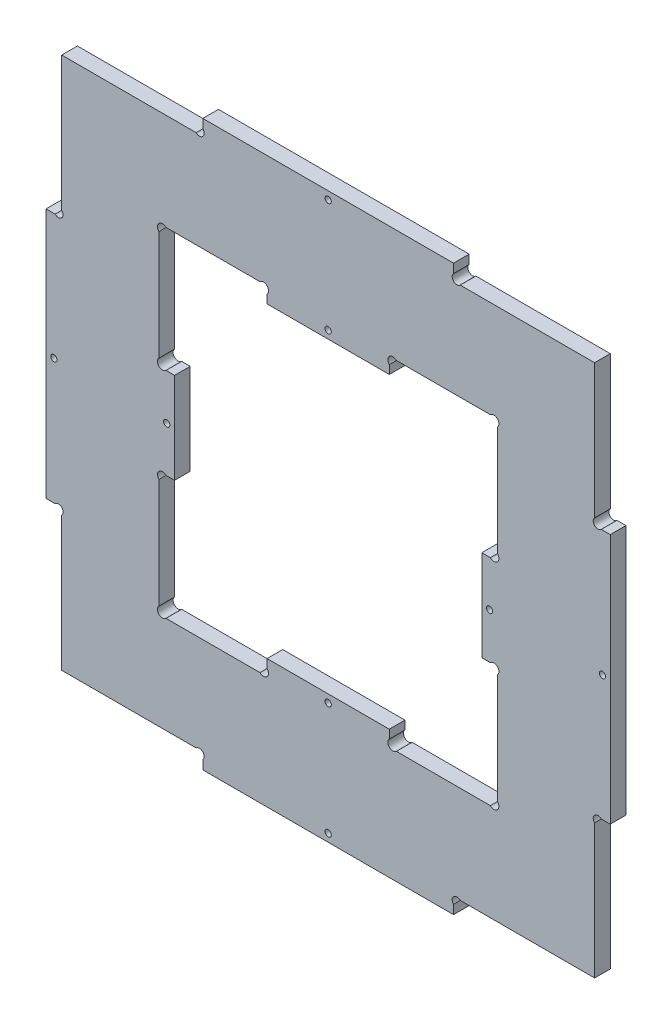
ISO-10303-21;
HEADER;
FILE_DESCRIPTION(('STEP AP214'),'2;1');
FILE_NAME('part.step','',(''),(''),'','','');
FILE_SCHEMA(('AUTOMOTIVE_DESIGN { 1 0 10303 214 1 1 1 1 }'));
ENDSEC;
DATA;
#1=APPLICATION_CONTEXT('core data for automotive mechanical design processes');
#2=APPLICATION_PROTOCOL_DEFINITION('international standard','automotive_design',2000,#1);
#3=PRODUCT_CONTEXT('',#1,'mechanical');
#4=PRODUCT('Part','Part','',(#3));
#5=PRODUCT_RELATED_PRODUCT_CATEGORY('part','',(#4));
#6=PRODUCT_DEFINITION_FORMATION('','',#4);
#7=PRODUCT_DEFINITION_CONTEXT('part definition',#1,'design');
#8=PRODUCT_DEFINITION('design','',#6,#7);
#9=PRODUCT_DEFINITION_SHAPE('','',#8);
#10=(LENGTH_UNIT() NAMED_UNIT(*) SI_UNIT(.MILLI.,.METRE.));
#11=(NAMED_UNIT(*) PLANE_ANGLE_UNIT() SI_UNIT($,.RADIAN.));
#12=(NAMED_UNIT(*) SI_UNIT($,.STERADIAN.) SOLID_ANGLE_UNIT());
#13=UNCERTAINTY_MEASURE_WITH_UNIT(LENGTH_MEASURE(1.E-05),#10,'distance_accuracy_value','');
#14=(GEOMETRIC_REPRESENTATION_CONTEXT(3) GLOBAL_UNCERTAINTY_ASSIGNED_CONTEXT((#13)) GLOBAL_UNIT_ASSIGNED_CONTEXT((#10,
#11,#12)) REPRESENTATION_CONTEXT('',''));
#15=CARTESIAN_POINT('',(0.,0.,0.));
#16=DIRECTION('',(0.,0.,1.));
#17=DIRECTION('',(1.,0.,0.));
#18=AXIS2_PLACEMENT_3D('',#15,#16,#17);
#19=CARTESIAN_POINT('',(72.2243867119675,62.0021330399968,5.));
#20=DIRECTION('',(0.,0.,1.));
#21=DIRECTION('',(1.,0.,0.));
#22=AXIS2_PLACEMENT_3D('',#19,#20,#21);
#23=PLANE('',#22);
#24=CARTESIAN_POINT('',(118.663726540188,-24.0585271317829,5.));
#25=DIRECTION('',(0.,0.,1.));
#26=DIRECTION('',(1.,0.,0.));
#27=AXIS2_PLACEMENT_3D('',#24,#25,#26);
#28=CIRCLE('',#27,0.999999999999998);
#29=CARTESIAN_POINT('',(119.663726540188,-24.0585271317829,5.));
#30=VERTEX_POINT('',#29);
#31=EDGE_CURVE('E1639',#30,#30,#28,.T.);
#32=ORIENTED_EDGE('',*,*,#31,.F.);
#33=EDGE_LOOP('',(#32));
#34=FACE_BOUND('',#33,.T.);
#35=CARTESIAN_POINT('',(-56.3362734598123,-24.0585271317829,5.));
#36=DIRECTION('',(0.,0.,1.));
#37=DIRECTION('',(1.,0.,0.));
#38=AXIS2_PLACEMENT_3D('',#35,#36,#37);
#39=CIRCLE('',#38,0.999999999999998);
#40=CARTESIAN_POINT('',(-55.3362734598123,-24.0585271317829,5.));
#41=VERTEX_POINT('',#40);
#42=EDGE_CURVE('E1651',#41,#41,#39,.T.);
#43=ORIENTED_EDGE('',*,*,#42,.F.);
#44=EDGE_LOOP('',(#43));
#45=FACE_BOUND('',#44,.T.);
#46=CARTESIAN_POINT('',(31.1637265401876,27.4414728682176,5.));
#47=DIRECTION('',(0.,0.,1.));
#48=DIRECTION('',(-1.,0.,0.));
#49=AXIS2_PLACEMENT_3D('',#46,#47,#48);
#50=CIRCLE('',#49,0.999999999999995);
#51=CARTESIAN_POINT('',(30.1637265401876,27.4414728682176,5.));
#52=VERTEX_POINT('',#51);
#53=EDGE_CURVE('E495',#52,#52,#50,.T.);
#54=ORIENTED_EDGE('',*,*,#53,.F.);
#55=EDGE_LOOP('',(#54));
#56=FACE_BOUND('',#55,.T.);
#57=CARTESIAN_POINT('',(-20.336273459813,-24.0585271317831,5.));
#58=DIRECTION('',(0.,0.,1.));
#59=DIRECTION('',(1.,0.,0.));
#60=AXIS2_PLACEMENT_3D('',#57,#58,#59);
#61=CIRCLE('',#60,1.);
#62=CARTESIAN_POINT('',(-19.336273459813,-24.0585271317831,5.));
#63=VERTEX_POINT('',#62);
#64=EDGE_CURVE('E645',#63,#63,#61,.T.);
#65=ORIENTED_EDGE('',*,*,#64,.F.);
#66=EDGE_LOOP('',(#65));
#67=FACE_BOUND('',#66,.T.);
#68=DIRECTION('',(0.,1.,0.));
#69=VECTOR('',#68,1.);
#70=CARTESIAN_POINT('',(71.1637265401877,65.9414728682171,5.));
#71=LINE('',#70,#69);
#72=CARTESIAN_POINT('',(71.1637265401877,63.0627932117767,5.));
#73=VERTEX_POINT('',#72);
#74=CARTESIAN_POINT('',(71.1637265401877,65.9414728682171,5.));
#75=VERTEX_POINT('',#74);
#76=EDGE_CURVE('E657',#73,#75,#71,.T.);
#77=ORIENTED_EDGE('',*,*,#76,.T.);
#78=DIRECTION('',(-1.,0.,0.));
#79=VECTOR('',#78,1.);
#80=CARTESIAN_POINT('',(-8.8362734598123,65.9414728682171,5.));
#81=LINE('',#80,#79);
#82=CARTESIAN_POINT('',(-8.8362734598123,65.9414728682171,5.));
#83=VERTEX_POINT('',#82);
#84=EDGE_CURVE('E660',#75,#83,#81,.T.);
#85=ORIENTED_EDGE('',*,*,#84,.T.);
#86=DIRECTION('',(0.,-1.,0.));
#87=VECTOR('',#86,1.);
#88=CARTESIAN_POINT('',(-8.8362734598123,63.0627932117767,5.));
#89=LINE('',#88,#87);
#90=CARTESIAN_POINT('',(-8.8362734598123,63.0627932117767,5.));
#91=VERTEX_POINT('',#90);
#92=EDGE_CURVE('E663',#83,#91,#89,.T.);
#93=ORIENTED_EDGE('',*,*,#92,.T.);
#94=CARTESIAN_POINT('',(-9.89693363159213,62.0021330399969,5.));
#95=DIRECTION('',(0.,0.,-1.));
#96=DIRECTION('',(1.,0.,0.));
#97=AXIS2_PLACEMENT_3D('',#94,#95,#96);
#98=CIRCLE('',#97,1.49999999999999);
#99=CARTESIAN_POINT('',(-10.9575938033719,60.9414728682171,5.));
#100=VERTEX_POINT('',#99);
#101=EDGE_CURVE('E665',#91,#100,#98,.T.);
#102=ORIENTED_EDGE('',*,*,#101,.T.);
#103=DIRECTION('',(-1.,0.,0.));
#104=VECTOR('',#103,1.);
#105=CARTESIAN_POINT('',(-53.8362734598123,60.9414728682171,5.));
#106=LINE('',#105,#104);
#107=CARTESIAN_POINT('',(-53.8362734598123,60.9414728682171,5.));
#108=VERTEX_POINT('',#107);
#109=EDGE_CURVE('E667',#100,#108,#106,.T.);
#110=ORIENTED_EDGE('',*,*,#109,.T.);
#111=DIRECTION('',(0.,-1.,0.));
#112=VECTOR('',#111,1.);
#113=CARTESIAN_POINT('',(-53.8362734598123,18.0627932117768,5.));
#114=LINE('',#113,#112);
#115=CARTESIAN_POINT('',(-53.8362734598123,18.0627932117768,5.));
#116=VERTEX_POINT('',#115);
#117=EDGE_CURVE('E669',#108,#116,#114,.T.);
#118=ORIENTED_EDGE('',*,*,#117,.T.);
#119=CARTESIAN_POINT('',(-54.8969336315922,17.0021330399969,5.));
#120=DIRECTION('',(0.,0.,-1.));
#121=DIRECTION('',(1.,0.,0.));
#122=AXIS2_PLACEMENT_3D('',#119,#120,#121);
#123=CIRCLE('',#122,1.50000000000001);
#124=CARTESIAN_POINT('',(-55.957593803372,15.9414728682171,5.));
#125=VERTEX_POINT('',#124);
#126=EDGE_CURVE('E671',#116,#125,#123,.T.);
#127=ORIENTED_EDGE('',*,*,#126,.T.);
#128=DIRECTION('',(-1.,0.,0.));
#129=VECTOR('',#128,1.);
#130=CARTESIAN_POINT('',(-58.8362734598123,15.9414728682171,5.));
#131=LINE('',#130,#129);
#132=CARTESIAN_POINT('',(-58.8362734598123,15.9414728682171,5.));
#133=VERTEX_POINT('',#132);
#134=EDGE_CURVE('E673',#125,#133,#131,.T.);
#135=ORIENTED_EDGE('',*,*,#134,.T.);
#136=DIRECTION('',(0.,-1.,0.));
#137=VECTOR('',#136,1.);
#138=CARTESIAN_POINT('',(-58.8362734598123,15.9414728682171,5.));
#139=LINE('',#138,#137);
#140=CARTESIAN_POINT('',(-58.8362734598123,-64.0585271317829,5.));
#141=VERTEX_POINT('',#140);
#142=EDGE_CURVE('E675',#133,#141,#139,.T.);
#143=ORIENTED_EDGE('',*,*,#142,.T.);
#144=DIRECTION('',(1.,0.,0.));
#145=VECTOR('',#144,1.);
#146=CARTESIAN_POINT('',(-55.957593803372,-64.058527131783,5.));
#147=LINE('',#146,#145);
#148=CARTESIAN_POINT('',(-55.957593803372,-64.058527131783,5.));
#149=VERTEX_POINT('',#148);
#150=EDGE_CURVE('E677',#141,#149,#147,.T.);
#151=ORIENTED_EDGE('',*,*,#150,.T.);
#152=CARTESIAN_POINT('',(-54.8969336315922,-65.1191873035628,5.));
#153=DIRECTION('',(0.,0.,-1.));
#154=DIRECTION('',(1.,0.,0.));
#155=AXIS2_PLACEMENT_3D('',#152,#153,#154);
#156=CIRCLE('',#155,1.50000000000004);
#157=CARTESIAN_POINT('',(-53.8362734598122,-66.1798474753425,5.));
#158=VERTEX_POINT('',#157);
#159=EDGE_CURVE('E679',#149,#158,#156,.T.);
#160=ORIENTED_EDGE('',*,*,#159,.T.);
#161=DIRECTION('',(0.,-1.,0.));
#162=VECTOR('',#161,1.);
#163=CARTESIAN_POINT('',(-53.8362734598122,-109.058527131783,5.));
#164=LINE('',#163,#162);
#165=CARTESIAN_POINT('',(-53.8362734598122,-109.058527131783,5.));
#166=VERTEX_POINT('',#165);
#167=EDGE_CURVE('E681',#158,#166,#164,.T.);
#168=ORIENTED_EDGE('',*,*,#167,.T.);
#169=DIRECTION('',(1.,0.,0.));
#170=VECTOR('',#169,1.);
#171=CARTESIAN_POINT('',(-10.9575938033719,-109.058527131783,5.));
#172=LINE('',#171,#170);
#173=CARTESIAN_POINT('',(-10.9575938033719,-109.058527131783,5.));
#174=VERTEX_POINT('',#173);
#175=EDGE_CURVE('E683',#166,#174,#172,.T.);
#176=ORIENTED_EDGE('',*,*,#175,.T.);
#177=CARTESIAN_POINT('',(-9.89693363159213,-110.119187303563,5.));
#178=DIRECTION('',(0.,0.,-1.));
#179=DIRECTION('',(1.,0.,0.));
#180=AXIS2_PLACEMENT_3D('',#177,#178,#179);
#181=CIRCLE('',#180,1.49999999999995);
#182=CARTESIAN_POINT('',(-8.83627345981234,-111.179847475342,5.));
#183=VERTEX_POINT('',#182);
#184=EDGE_CURVE('E685',#174,#183,#181,.T.);
#185=ORIENTED_EDGE('',*,*,#184,.T.);
#186=DIRECTION('',(0.,-1.,0.));
#187=VECTOR('',#186,1.);
#188=CARTESIAN_POINT('',(-8.83627345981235,-114.058527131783,5.));
#189=LINE('',#188,#187);
#190=CARTESIAN_POINT('',(-8.83627345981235,-114.058527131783,5.));
#191=VERTEX_POINT('',#190);
#192=EDGE_CURVE('E687',#183,#191,#189,.T.);
#193=ORIENTED_EDGE('',*,*,#192,.T.);
#194=DIRECTION('',(1.,0.,0.));
#195=VECTOR('',#194,1.);
#196=CARTESIAN_POINT('',(-8.83627345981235,-114.058527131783,5.));
#197=LINE('',#196,#195);
#198=CARTESIAN_POINT('',(71.1637265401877,-114.058527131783,5.));
#199=VERTEX_POINT('',#198);
#200=EDGE_CURVE('E689',#191,#199,#197,.T.);
#201=ORIENTED_EDGE('',*,*,#200,.T.);
#202=DIRECTION('',(0.,1.,0.));
#203=VECTOR('',#202,1.);
#204=CARTESIAN_POINT('',(71.1637265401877,-114.058527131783,5.));
#205=LINE('',#204,#203);
#206=CARTESIAN_POINT('',(71.1637265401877,-111.179847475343,5.));
#207=VERTEX_POINT('',#206);
#208=EDGE_CURVE('E691',#199,#207,#205,.T.);
#209=ORIENTED_EDGE('',*,*,#208,.T.);
#210=CARTESIAN_POINT('',(72.2243867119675,-110.119187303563,5.));
#211=DIRECTION('',(0.,0.,-1.));
#212=DIRECTION('',(1.,0.,0.));
#213=AXIS2_PLACEMENT_3D('',#210,#211,#212);
#214=CIRCLE('',#213,1.49999999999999);
#215=CARTESIAN_POINT('',(73.2850468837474,-109.058527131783,5.));
#216=VERTEX_POINT('',#215);
#217=EDGE_CURVE('E693',#207,#216,#214,.T.);
#218=ORIENTED_EDGE('',*,*,#217,.T.);
#219=DIRECTION('',(1.,0.,0.));
#220=VECTOR('',#219,1.);
#221=CARTESIAN_POINT('',(73.2850468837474,-109.058527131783,5.));
#222=LINE('',#221,#220);
#223=CARTESIAN_POINT('',(116.163726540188,-109.058527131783,5.));
#224=VERTEX_POINT('',#223);
#225=EDGE_CURVE('E695',#216,#224,#222,.T.);
#226=ORIENTED_EDGE('',*,*,#225,.T.);
#227=DIRECTION('',(0.,1.,0.));
#228=VECTOR('',#227,1.);
#229=CARTESIAN_POINT('',(116.163726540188,-109.058527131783,5.));
#230=LINE('',#229,#228);
#231=CARTESIAN_POINT('',(116.163726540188,-66.1798474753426,5.));
#232=VERTEX_POINT('',#231);
#233=EDGE_CURVE('E697',#224,#232,#230,.T.);
#234=ORIENTED_EDGE('',*,*,#233,.T.);
#235=CARTESIAN_POINT('',(117.224386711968,-65.1191873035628,5.));
#236=DIRECTION('',(0.,0.,-1.));
#237=DIRECTION('',(1.,0.,0.));
#238=AXIS2_PLACEMENT_3D('',#235,#236,#237);
#239=CIRCLE('',#238,1.49999999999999);
#240=CARTESIAN_POINT('',(118.285046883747,-64.0585271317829,5.));
#241=VERTEX_POINT('',#240);
#242=EDGE_CURVE('E699',#232,#241,#239,.T.);
#243=ORIENTED_EDGE('',*,*,#242,.T.);
#244=DIRECTION('',(1.,0.,0.));
#245=VECTOR('',#244,1.);
#246=CARTESIAN_POINT('',(118.285046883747,-64.0585271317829,5.));
#247=LINE('',#246,#245);
#248=CARTESIAN_POINT('',(121.163726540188,-64.0585271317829,5.));
#249=VERTEX_POINT('',#248);
#250=EDGE_CURVE('E701',#241,#249,#247,.T.);
#251=ORIENTED_EDGE('',*,*,#250,.T.);
#252=DIRECTION('',(0.,1.,0.));
#253=VECTOR('',#252,1.);
#254=CARTESIAN_POINT('',(121.163726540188,15.9414728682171,5.));
#255=LINE('',#254,#253);
#256=CARTESIAN_POINT('',(121.163726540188,15.9414728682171,5.));
#257=VERTEX_POINT('',#256);
#258=EDGE_CURVE('E703',#249,#257,#255,.T.);
#259=ORIENTED_EDGE('',*,*,#258,.T.);
#260=DIRECTION('',(-1.,0.,0.));
#261=VECTOR('',#260,1.);
#262=CARTESIAN_POINT('',(118.285046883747,15.9414728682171,5.));
#263=LINE('',#262,#261);
#264=CARTESIAN_POINT('',(118.285046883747,15.9414728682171,5.));
#265=VERTEX_POINT('',#264);
#266=EDGE_CURVE('E705',#257,#265,#263,.T.);
#267=ORIENTED_EDGE('',*,*,#266,.T.);
#268=CARTESIAN_POINT('',(117.224386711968,17.0021330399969,5.));
#269=DIRECTION('',(0.,0.,-1.));
#270=DIRECTION('',(1.,0.,0.));
#271=AXIS2_PLACEMENT_3D('',#268,#269,#270);
#272=CIRCLE('',#271,1.49999999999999);
#273=CARTESIAN_POINT('',(116.163726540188,18.0627932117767,5.));
#274=VERTEX_POINT('',#273);
#275=EDGE_CURVE('E707',#265,#274,#272,.T.);
#276=ORIENTED_EDGE('',*,*,#275,.T.);
#277=DIRECTION('',(0.,1.,0.));
#278=VECTOR('',#277,1.);
#279=CARTESIAN_POINT('',(116.163726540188,60.941472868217,5.));
#280=LINE('',#279,#278);
#281=CARTESIAN_POINT('',(116.163726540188,60.941472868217,5.));
#282=VERTEX_POINT('',#281);
#283=EDGE_CURVE('E709',#274,#282,#280,.T.);
#284=ORIENTED_EDGE('',*,*,#283,.T.);
#285=DIRECTION('',(-1.,0.,0.));
#286=VECTOR('',#285,1.);
#287=CARTESIAN_POINT('',(73.2850468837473,60.941472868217,5.));
#288=LINE('',#287,#286);
#289=CARTESIAN_POINT('',(73.2850468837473,60.941472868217,5.));
#290=VERTEX_POINT('',#289);
#291=EDGE_CURVE('E711',#282,#290,#288,.T.);
#292=ORIENTED_EDGE('',*,*,#291,.T.);
#293=CARTESIAN_POINT('',(72.2243867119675,62.0021330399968,5.));
#294=DIRECTION('',(0.,0.,-1.));
#295=DIRECTION('',(1.,0.,0.));
#296=AXIS2_PLACEMENT_3D('',#293,#294,#295);
#297=CIRCLE('',#296,1.5);
#298=EDGE_CURVE('E713',#290,#73,#297,.T.);
#299=ORIENTED_EDGE('',*,*,#298,.T.);
#300=EDGE_LOOP('',(#77,#85,#93,#102,#110,#118,#127,#135,#143,#151,#160,#168,#176,#185,#193,#201,
#209,#218,#226,#234,#243,#251,#259,#267,#276,#284,#292,#299));
#301=FACE_BOUND('',#300,.T.);
#302=CARTESIAN_POINT('',(31.1637265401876,-75.5585271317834,5.));
#303=DIRECTION('',(0.,0.,1.));
#304=DIRECTION('',(1.,0.,0.));
#305=AXIS2_PLACEMENT_3D('',#302,#303,#304);
#306=CIRCLE('',#305,0.999999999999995);
#307=CARTESIAN_POINT('',(32.1637265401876,-75.5585271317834,5.));
#308=VERTEX_POINT('',#307);
#309=EDGE_CURVE('E651',#308,#308,#306,.T.);
#310=ORIENTED_EDGE('',*,*,#309,.F.);
#311=EDGE_LOOP('',(#310));
#312=FACE_BOUND('',#311,.T.);
#313=DIRECTION('',(0.,1.,0.));
#314=VECTOR('',#313,1.);
#315=CARTESIAN_POINT('',(11.6637265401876,24.9414728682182,5.));
#316=LINE('',#315,#314);
#317=CARTESIAN_POINT('',(11.6637265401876,24.9414728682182,5.));
#318=VERTEX_POINT('',#317);
#319=CARTESIAN_POINT('',(11.6637265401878,27.6787311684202,5.));
#320=VERTEX_POINT('',#319);
#321=EDGE_CURVE('E417',#318,#320,#316,.T.);
#322=ORIENTED_EDGE('',*,*,#321,.F.);
#323=DIRECTION('',(-1.,0.,0.));
#324=VECTOR('',#323,1.);
#325=CARTESIAN_POINT('',(11.6637265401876,24.9414728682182,5.));
#326=LINE('',#325,#324);
#327=CARTESIAN_POINT('',(50.6637265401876,24.9414728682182,5.));
#328=VERTEX_POINT('',#327);
#329=EDGE_CURVE('E409',#328,#318,#326,.T.);
#330=ORIENTED_EDGE('',*,*,#329,.F.);
#331=DIRECTION('',(0.,-1.,0.));
#332=VECTOR('',#331,1.);
#333=CARTESIAN_POINT('',(50.6637265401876,24.9414728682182,5.));
#334=LINE('',#333,#332);
#335=CARTESIAN_POINT('',(50.6637265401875,27.6787311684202,5.));
#336=VERTEX_POINT('',#335);
#337=EDGE_CURVE('E492',#336,#328,#334,.T.);
#338=ORIENTED_EDGE('',*,*,#337,.F.);
#339=CARTESIAN_POINT('',(51.795097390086,28.8101020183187,5.));
#340=DIRECTION('',(0.,0.,1.));
#341=DIRECTION('',(1.,0.,0.));
#342=AXIS2_PLACEMENT_3D('',#339,#340,#341);
#343=CIRCLE('',#342,1.60000000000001);
#344=CARTESIAN_POINT('',(52.9264682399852,29.9414728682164,5.));
#345=VERTEX_POINT('',#344);
#346=EDGE_CURVE('E490',#345,#336,#343,.T.);
#347=ORIENTED_EDGE('',*,*,#346,.F.);
#348=DIRECTION('',(-1.,0.,0.));
#349=VECTOR('',#348,1.);
#350=CARTESIAN_POINT('',(82.9009848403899,29.9414728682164,5.));
#351=LINE('',#350,#349);
#352=CARTESIAN_POINT('',(82.9009848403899,29.9414728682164,5.));
#353=VERTEX_POINT('',#352);
#354=EDGE_CURVE('E488',#353,#345,#351,.T.);
#355=ORIENTED_EDGE('',*,*,#354,.F.);
#356=CARTESIAN_POINT('',(84.0323556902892,28.8101020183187,5.));
#357=DIRECTION('',(0.,0.,1.));
#358=DIRECTION('',(1.,0.,0.));
#359=AXIS2_PLACEMENT_3D('',#356,#357,#358);
#360=CIRCLE('',#359,1.59999999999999);
#361=CARTESIAN_POINT('',(85.1637265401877,27.6787311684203,5.));
#362=VERTEX_POINT('',#361);
#363=EDGE_CURVE('E486',#362,#353,#360,.T.);
#364=ORIENTED_EDGE('',*,*,#363,.F.);
#365=DIRECTION('',(0.,1.,0.));
#366=VECTOR('',#365,1.);
#367=CARTESIAN_POINT('',(85.1637265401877,-7.29578543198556,5.));
#368=LINE('',#367,#366);
#369=CARTESIAN_POINT('',(85.1637265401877,-7.29578543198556,5.));
#370=VERTEX_POINT('',#369);
#371=EDGE_CURVE('E484',#370,#362,#368,.T.);
#372=ORIENTED_EDGE('',*,*,#371,.F.);
#373=CARTESIAN_POINT('',(84.0323556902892,-8.42715628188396,5.));
#374=DIRECTION('',(0.,0.,1.));
#375=DIRECTION('',(1.,0.,0.));
#376=AXIS2_PLACEMENT_3D('',#373,#374,#375);
#377=CIRCLE('',#376,1.6);
#378=CARTESIAN_POINT('',(82.9009848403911,-9.55852713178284,5.));
#379=VERTEX_POINT('',#378);
#380=EDGE_CURVE('E482',#379,#370,#377,.T.);
#381=ORIENTED_EDGE('',*,*,#380,.F.);
#382=DIRECTION('',(1.,0.,0.));
#383=VECTOR('',#382,1.);
#384=CARTESIAN_POINT('',(80.1637265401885,-9.55852713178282,5.));
#385=LINE('',#384,#383);
#386=CARTESIAN_POINT('',(80.1637265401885,-9.55852713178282,5.));
#387=VERTEX_POINT('',#386);
#388=EDGE_CURVE('E480',#387,#379,#385,.T.);
#389=ORIENTED_EDGE('',*,*,#388,.F.);
#390=DIRECTION('',(0.,1.,0.));
#391=VECTOR('',#390,1.);
#392=CARTESIAN_POINT('',(80.1637265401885,-9.55852713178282,5.));
#393=LINE('',#392,#391);
#394=CARTESIAN_POINT('',(80.1637265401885,-38.5585271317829,5.));
#395=VERTEX_POINT('',#394);
#396=EDGE_CURVE('E478',#395,#387,#393,.T.);
#397=ORIENTED_EDGE('',*,*,#396,.F.);
#398=DIRECTION('',(-1.,0.,0.));
#399=VECTOR('',#398,1.);
#400=CARTESIAN_POINT('',(80.1637265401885,-38.5585271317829,5.));
#401=LINE('',#400,#399);
#402=CARTESIAN_POINT('',(82.9009848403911,-38.5585271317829,5.));
#403=VERTEX_POINT('',#402);
#404=EDGE_CURVE('E476',#403,#395,#401,.T.);
#405=ORIENTED_EDGE('',*,*,#404,.F.);
#406=CARTESIAN_POINT('',(84.0323556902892,-39.6898979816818,5.));
#407=DIRECTION('',(0.,0.,1.));
#408=DIRECTION('',(-1.,0.,0.));
#409=AXIS2_PLACEMENT_3D('',#406,#407,#408);
#410=CIRCLE('',#409,1.6);
#411=CARTESIAN_POINT('',(85.1637265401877,-40.8212688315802,5.));
#412=VERTEX_POINT('',#411);
#413=EDGE_CURVE('E474',#412,#403,#410,.T.);
#414=ORIENTED_EDGE('',*,*,#413,.F.);
#415=DIRECTION('',(0.,1.,0.));
#416=VECTOR('',#415,1.);
#417=CARTESIAN_POINT('',(85.1637265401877,-40.8212688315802,5.));
#418=LINE('',#417,#416);
#419=CARTESIAN_POINT('',(85.1637265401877,-75.795785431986,5.));
#420=VERTEX_POINT('',#419);
#421=EDGE_CURVE('E472',#420,#412,#418,.T.);
#422=ORIENTED_EDGE('',*,*,#421,.F.);
#423=CARTESIAN_POINT('',(84.0323556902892,-76.9271562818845,5.));
#424=DIRECTION('',(0.,0.,1.));
#425=DIRECTION('',(-1.,0.,0.));
#426=AXIS2_PLACEMENT_3D('',#423,#424,#425);
#427=CIRCLE('',#426,1.59999999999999);
#428=CARTESIAN_POINT('',(82.9009848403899,-78.0585271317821,5.));
#429=VERTEX_POINT('',#428);
#430=EDGE_CURVE('E470',#429,#420,#427,.T.);
#431=ORIENTED_EDGE('',*,*,#430,.F.);
#432=DIRECTION('',(1.,0.,0.));
#433=VECTOR('',#432,1.);
#434=CARTESIAN_POINT('',(82.9009848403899,-78.0585271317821,5.));
#435=LINE('',#434,#433);
#436=CARTESIAN_POINT('',(52.9264682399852,-78.0585271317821,5.));
#437=VERTEX_POINT('',#436);
#438=EDGE_CURVE('E468',#437,#429,#435,.T.);
#439=ORIENTED_EDGE('',*,*,#438,.F.);
#440=CARTESIAN_POINT('',(51.795097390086,-76.9271562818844,5.));
#441=DIRECTION('',(0.,0.,1.));
#442=DIRECTION('',(-1.,0.,0.));
#443=AXIS2_PLACEMENT_3D('',#440,#441,#442);
#444=CIRCLE('',#443,1.60000000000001);
#445=CARTESIAN_POINT('',(50.6637265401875,-75.7957854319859,5.));
#446=VERTEX_POINT('',#445);
#447=EDGE_CURVE('E466',#446,#437,#444,.T.);
#448=ORIENTED_EDGE('',*,*,#447,.F.);
#449=DIRECTION('',(0.,-1.,0.));
#450=VECTOR('',#449,1.);
#451=CARTESIAN_POINT('',(50.6637265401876,-73.0585271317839,5.));
#452=LINE('',#451,#450);
#453=CARTESIAN_POINT('',(50.6637265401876,-73.0585271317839,5.));
#454=VERTEX_POINT('',#453);
#455=EDGE_CURVE('E464',#454,#446,#452,.T.);
#456=ORIENTED_EDGE('',*,*,#455,.F.);
#457=DIRECTION('',(1.,0.,0.));
#458=VECTOR('',#457,1.);
#459=CARTESIAN_POINT('',(50.6637265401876,-73.0585271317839,5.));
#460=LINE('',#459,#458);
#461=CARTESIAN_POINT('',(11.6637265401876,-73.0585271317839,5.));
#462=VERTEX_POINT('',#461);
#463=EDGE_CURVE('E462',#462,#454,#460,.T.);
#464=ORIENTED_EDGE('',*,*,#463,.F.);
#465=DIRECTION('',(0.,1.,0.));
#466=VECTOR('',#465,1.);
#467=CARTESIAN_POINT('',(11.6637265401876,-73.0585271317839,5.));
#468=LINE('',#467,#466);
#469=CARTESIAN_POINT('',(11.6637265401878,-75.7957854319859,5.));
#470=VERTEX_POINT('',#469);
#471=EDGE_CURVE('E460',#470,#462,#468,.T.);
#472=ORIENTED_EDGE('',*,*,#471,.F.);
#473=CARTESIAN_POINT('',(10.5323556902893,-76.9271562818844,5.));
#474=DIRECTION('',(0.,0.,1.));
#475=DIRECTION('',(1.,0.,0.));
#476=AXIS2_PLACEMENT_3D('',#473,#474,#475);
#477=CIRCLE('',#476,1.60000000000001);
#478=CARTESIAN_POINT('',(9.40098484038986,-78.0585271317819,5.));
#479=VERTEX_POINT('',#478);
#480=EDGE_CURVE('E458',#479,#470,#477,.T.);
#481=ORIENTED_EDGE('',*,*,#480,.F.);
#482=DIRECTION('',(1.,0.,0.));
#483=VECTOR('',#482,1.);
#484=CARTESIAN_POINT('',(-20.5735317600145,-78.0585271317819,5.));
#485=LINE('',#484,#483);
#486=CARTESIAN_POINT('',(-20.5735317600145,-78.0585271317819,5.));
#487=VERTEX_POINT('',#486);
#488=EDGE_CURVE('E456',#487,#479,#485,.T.);
#489=ORIENTED_EDGE('',*,*,#488,.F.);
#490=CARTESIAN_POINT('',(-21.7049026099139,-76.9271562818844,5.));
#491=DIRECTION('',(0.,0.,1.));
#492=DIRECTION('',(1.,0.,0.));
#493=AXIS2_PLACEMENT_3D('',#490,#491,#492);
#494=CIRCLE('',#493,1.59999999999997);
#495=CARTESIAN_POINT('',(-22.8362734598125,-75.7957854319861,5.));
#496=VERTEX_POINT('',#495);
#497=EDGE_CURVE('E454',#496,#487,#494,.T.);
#498=ORIENTED_EDGE('',*,*,#497,.F.);
#499=DIRECTION('',(0.,-1.,0.));
#500=VECTOR('',#499,1.);
#501=CARTESIAN_POINT('',(-22.8362734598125,-40.8212688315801,5.));
#502=LINE('',#501,#500);
#503=CARTESIAN_POINT('',(-22.8362734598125,-40.8212688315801,5.));
#504=VERTEX_POINT('',#503);
#505=EDGE_CURVE('E452',#504,#496,#502,.T.);
#506=ORIENTED_EDGE('',*,*,#505,.F.);
#507=CARTESIAN_POINT('',(-21.7049026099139,-39.6898979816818,5.));
#508=DIRECTION('',(0.,0.,1.));
#509=DIRECTION('',(1.,0.,0.));
#510=AXIS2_PLACEMENT_3D('',#507,#508,#509);
#511=CIRCLE('',#510,1.60000000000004);
#512=CARTESIAN_POINT('',(-20.5735317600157,-38.5585271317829,5.));
#513=VERTEX_POINT('',#512);
#514=EDGE_CURVE('E450',#513,#504,#511,.T.);
#515=ORIENTED_EDGE('',*,*,#514,.F.);
#516=DIRECTION('',(-1.,0.,0.));
#517=VECTOR('',#516,1.);
#518=CARTESIAN_POINT('',(-17.8362734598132,-38.5585271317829,5.));
#519=LINE('',#518,#517);
#520=CARTESIAN_POINT('',(-17.8362734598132,-38.5585271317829,5.));
#521=VERTEX_POINT('',#520);
#522=EDGE_CURVE('E448',#521,#513,#519,.T.);
#523=ORIENTED_EDGE('',*,*,#522,.F.);
#524=DIRECTION('',(0.,-1.,0.));
#525=VECTOR('',#524,1.);
#526=CARTESIAN_POINT('',(-17.8362734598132,-9.55852713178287,5.));
#527=LINE('',#526,#525);
#528=CARTESIAN_POINT('',(-17.8362734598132,-9.55852713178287,5.));
#529=VERTEX_POINT('',#528);
#530=EDGE_CURVE('E446',#529,#521,#527,.T.);
#531=ORIENTED_EDGE('',*,*,#530,.F.);
#532=DIRECTION('',(1.,0.,0.));
#533=VECTOR('',#532,1.);
#534=CARTESIAN_POINT('',(-17.8362734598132,-9.55852713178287,5.));
#535=LINE('',#534,#533);
#536=CARTESIAN_POINT('',(-20.5735317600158,-9.55852713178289,5.));
#537=VERTEX_POINT('',#536);
#538=EDGE_CURVE('E444',#537,#529,#535,.T.);
#539=ORIENTED_EDGE('',*,*,#538,.F.);
#540=CARTESIAN_POINT('',(-21.7049026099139,-8.42715628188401,5.));
#541=DIRECTION('',(0.,0.,1.));
#542=DIRECTION('',(-1.,0.,0.));
#543=AXIS2_PLACEMENT_3D('',#540,#541,#542);
#544=CIRCLE('',#543,1.6);
#545=CARTESIAN_POINT('',(-22.8362734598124,-7.29578543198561,5.));
#546=VERTEX_POINT('',#545);
#547=EDGE_CURVE('E442',#546,#537,#544,.T.);
#548=ORIENTED_EDGE('',*,*,#547,.F.);
#549=DIRECTION('',(0.,-1.,0.));
#550=VECTOR('',#549,1.);
#551=CARTESIAN_POINT('',(-22.8362734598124,-7.29578543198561,5.));
#552=LINE('',#551,#550);
#553=CARTESIAN_POINT('',(-22.8362734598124,27.6787311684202,5.));
#554=VERTEX_POINT('',#553);
#555=EDGE_CURVE('E440',#554,#546,#552,.T.);
#556=ORIENTED_EDGE('',*,*,#555,.F.);
#557=CARTESIAN_POINT('',(-21.7049026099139,28.8101020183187,5.));
#558=DIRECTION('',(0.,0.,1.));
#559=DIRECTION('',(-1.,0.,0.));
#560=AXIS2_PLACEMENT_3D('',#557,#558,#559);
#561=CIRCLE('',#560,1.59999999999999);
#562=CARTESIAN_POINT('',(-20.5735317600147,29.9414728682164,5.));
#563=VERTEX_POINT('',#562);
#564=EDGE_CURVE('E438',#563,#554,#561,.T.);
#565=ORIENTED_EDGE('',*,*,#564,.F.);
#566=DIRECTION('',(-1.,0.,0.));
#567=VECTOR('',#566,1.);
#568=CARTESIAN_POINT('',(-20.5735317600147,29.9414728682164,5.));
#569=LINE('',#568,#567);
#570=CARTESIAN_POINT('',(9.40098484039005,29.9414728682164,5.));
#571=VERTEX_POINT('',#570);
#572=EDGE_CURVE('E433',#571,#563,#569,.T.);
#573=ORIENTED_EDGE('',*,*,#572,.F.);
#574=CARTESIAN_POINT('',(10.5323556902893,28.8101020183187,5.));
#575=DIRECTION('',(0.,0.,1.));
#576=DIRECTION('',(-1.,0.,0.));
#577=AXIS2_PLACEMENT_3D('',#574,#575,#576);
#578=CIRCLE('',#577,1.60000000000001);
#579=EDGE_CURVE('E431',#320,#571,#578,.T.);
#580=ORIENTED_EDGE('',*,*,#579,.F.);
#581=EDGE_LOOP('',(#322,#330,#338,#347,#355,#364,#372,#381,#389,#397,#405,#414,#422,#431,#439,
#448,#456,#464,#472,#481,#489,#498,#506,#515,#523,#531,#539,#548,#556,#565,#573,#580));
#582=FACE_BOUND('',#581,.T.);
#583=CARTESIAN_POINT('',(82.6637265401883,-24.058527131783,5.));
#584=DIRECTION('',(0.,0.,1.));
#585=DIRECTION('',(-1.,0.,0.));
#586=AXIS2_PLACEMENT_3D('',#583,#584,#585);
#587=CIRCLE('',#586,1.00000000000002);
#588=CARTESIAN_POINT('',(81.6637265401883,-24.058527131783,5.));
#589=VERTEX_POINT('',#588);
#590=EDGE_CURVE('E1657',#589,#589,#587,.T.);
#591=ORIENTED_EDGE('',*,*,#590,.F.);
#592=EDGE_LOOP('',(#591));
#593=FACE_BOUND('',#592,.T.);
#594=CARTESIAN_POINT('',(31.1637265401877,63.441472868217,5.));
#595=DIRECTION('',(0.,0.,1.));
#596=DIRECTION('',(1.,0.,0.));
#597=AXIS2_PLACEMENT_3D('',#594,#595,#596);
#598=CIRCLE('',#597,0.999999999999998);
#599=CARTESIAN_POINT('',(32.1637265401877,63.441472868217,5.));
#600=VERTEX_POINT('',#599);
#601=EDGE_CURVE('E1645',#600,#600,#598,.T.);
#602=ORIENTED_EDGE('',*,*,#601,.F.);
#603=EDGE_LOOP('',(#602));
#604=FACE_BOUND('',#603,.T.);
#605=CARTESIAN_POINT('',(31.1637265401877,-111.558527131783,5.));
#606=DIRECTION('',(0.,0.,1.));
#607=DIRECTION('',(1.,0.,0.));
#608=AXIS2_PLACEMENT_3D('',#605,#606,#607);
#609=CIRCLE('',#608,0.999999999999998);
#610=CARTESIAN_POINT('',(32.1637265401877,-111.558527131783,5.));
#611=VERTEX_POINT('',#610);
#612=EDGE_CURVE('E1630',#611,#611,#609,.T.);
#613=ORIENTED_EDGE('',*,*,#612,.F.);
#614=EDGE_LOOP('',(#613));
#615=FACE_BOUND('',#614,.T.);
#616=ADVANCED_FACE('F32',(#34,#45,#56,#67,#301,#312,#582,#593,#604,#615),#23,.T.);
#617=CARTESIAN_POINT('',(72.2243867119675,62.0021330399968,0.));
#618=DIRECTION('',(0.,0.,1.));
#619=DIRECTION('',(1.,0.,0.));
#620=AXIS2_PLACEMENT_3D('',#617,#618,#619);
#621=PLANE('',#620);
#622=CARTESIAN_POINT('',(118.663726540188,-24.0585271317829,0.));
#623=DIRECTION('',(0.,0.,1.));
#624=DIRECTION('',(1.,0.,0.));
#625=AXIS2_PLACEMENT_3D('',#622,#623,#624);
#626=CIRCLE('',#625,0.999999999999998);
#627=CARTESIAN_POINT('',(119.663726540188,-24.0585271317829,0.));
#628=VERTEX_POINT('',#627);
#629=EDGE_CURVE('E1636',#628,#628,#626,.T.);
#630=ORIENTED_EDGE('',*,*,#629,.T.);
#631=EDGE_LOOP('',(#630));
#632=FACE_BOUND('',#631,.T.);
#633=CARTESIAN_POINT('',(-56.3362734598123,-24.0585271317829,0.));
#634=DIRECTION('',(0.,0.,1.));
#635=DIRECTION('',(1.,0.,0.));
#636=AXIS2_PLACEMENT_3D('',#633,#634,#635);
#637=CIRCLE('',#636,0.999999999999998);
#638=CARTESIAN_POINT('',(-55.3362734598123,-24.0585271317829,0.));
#639=VERTEX_POINT('',#638);
#640=EDGE_CURVE('E1648',#639,#639,#637,.T.);
#641=ORIENTED_EDGE('',*,*,#640,.T.);
#642=EDGE_LOOP('',(#641));
#643=FACE_BOUND('',#642,.T.);
#644=CARTESIAN_POINT('',(31.1637265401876,27.4414728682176,0.));
#645=DIRECTION('',(0.,0.,1.));
#646=DIRECTION('',(-1.,0.,0.));
#647=AXIS2_PLACEMENT_3D('',#644,#645,#646);
#648=CIRCLE('',#647,0.999999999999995);
#649=CARTESIAN_POINT('',(30.1637265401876,27.4414728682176,0.));
#650=VERTEX_POINT('',#649);
#651=EDGE_CURVE('E1660',#650,#650,#648,.T.);
#652=ORIENTED_EDGE('',*,*,#651,.T.);
#653=EDGE_LOOP('',(#652));
#654=FACE_BOUND('',#653,.T.);
#655=CARTESIAN_POINT('',(-20.336273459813,-24.0585271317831,0.));
#656=DIRECTION('',(0.,0.,1.));
#657=DIRECTION('',(1.,0.,0.));
#658=AXIS2_PLACEMENT_3D('',#655,#656,#657);
#659=CIRCLE('',#658,1.);
#660=CARTESIAN_POINT('',(-19.336273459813,-24.0585271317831,0.));
#661=VERTEX_POINT('',#660);
#662=EDGE_CURVE('E425',#661,#661,#659,.T.);
#663=ORIENTED_EDGE('',*,*,#662,.T.);
#664=EDGE_LOOP('',(#663));
#665=FACE_BOUND('',#664,.T.);
#666=DIRECTION('',(0.,1.,0.));
#667=VECTOR('',#666,1.);
#668=CARTESIAN_POINT('',(71.1637265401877,65.9414728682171,0.));
#669=LINE('',#668,#667);
#670=CARTESIAN_POINT('',(71.1637265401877,63.0627932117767,0.));
#671=VERTEX_POINT('',#670);
#672=CARTESIAN_POINT('',(71.1637265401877,65.9414728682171,0.));
#673=VERTEX_POINT('',#672);
#674=EDGE_CURVE('E654',#671,#673,#669,.T.);
#675=ORIENTED_EDGE('',*,*,#674,.F.);
#676=CARTESIAN_POINT('',(72.2243867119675,62.0021330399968,0.));
#677=DIRECTION('',(0.,0.,-1.));
#678=DIRECTION('',(1.,0.,0.));
#679=AXIS2_PLACEMENT_3D('',#676,#677,#678);
#680=CIRCLE('',#679,1.5);
#681=CARTESIAN_POINT('',(73.2850468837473,60.941472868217,0.));
#682=VERTEX_POINT('',#681);
#683=EDGE_CURVE('E661',#682,#671,#680,.T.);
#684=ORIENTED_EDGE('',*,*,#683,.F.);
#685=DIRECTION('',(-1.,0.,0.));
#686=VECTOR('',#685,1.);
#687=CARTESIAN_POINT('',(73.2850468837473,60.941472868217,0.));
#688=LINE('',#687,#686);
#689=CARTESIAN_POINT('',(116.163726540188,60.941472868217,0.));
#690=VERTEX_POINT('',#689);
#691=EDGE_CURVE('E768',#690,#682,#688,.T.);
#692=ORIENTED_EDGE('',*,*,#691,.F.);
#693=DIRECTION('',(0.,1.,0.));
#694=VECTOR('',#693,1.);
#695=CARTESIAN_POINT('',(116.163726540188,60.941472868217,0.));
#696=LINE('',#695,#694);
#697=CARTESIAN_POINT('',(116.163726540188,18.0627932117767,0.));
#698=VERTEX_POINT('',#697);
#699=EDGE_CURVE('E766',#698,#690,#696,.T.);
#700=ORIENTED_EDGE('',*,*,#699,.F.);
#701=CARTESIAN_POINT('',(117.224386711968,17.0021330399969,0.));
#702=DIRECTION('',(0.,0.,-1.));
#703=DIRECTION('',(1.,0.,0.));
#704=AXIS2_PLACEMENT_3D('',#701,#702,#703);
#705=CIRCLE('',#704,1.49999999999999);
#706=CARTESIAN_POINT('',(118.285046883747,15.9414728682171,0.));
#707=VERTEX_POINT('',#706);
#708=EDGE_CURVE('E764',#707,#698,#705,.T.);
#709=ORIENTED_EDGE('',*,*,#708,.F.);
#710=DIRECTION('',(-1.,0.,0.));
#711=VECTOR('',#710,1.);
#712=CARTESIAN_POINT('',(118.285046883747,15.9414728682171,0.));
#713=LINE('',#712,#711);
#714=CARTESIAN_POINT('',(121.163726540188,15.9414728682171,0.));
#715=VERTEX_POINT('',#714);
#716=EDGE_CURVE('E762',#715,#707,#713,.T.);
#717=ORIENTED_EDGE('',*,*,#716,.F.);
#718=DIRECTION('',(0.,1.,0.));
#719=VECTOR('',#718,1.);
#720=CARTESIAN_POINT('',(121.163726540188,15.9414728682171,0.));
#721=LINE('',#720,#719);
#722=CARTESIAN_POINT('',(121.163726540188,-64.0585271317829,0.));
#723=VERTEX_POINT('',#722);
#724=EDGE_CURVE('E760',#723,#715,#721,.T.);
#725=ORIENTED_EDGE('',*,*,#724,.F.);
#726=DIRECTION('',(1.,0.,0.));
#727=VECTOR('',#726,1.);
#728=CARTESIAN_POINT('',(118.285046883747,-64.0585271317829,0.));
#729=LINE('',#728,#727);
#730=CARTESIAN_POINT('',(118.285046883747,-64.0585271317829,0.));
#731=VERTEX_POINT('',#730);
#732=EDGE_CURVE('E758',#731,#723,#729,.T.);
#733=ORIENTED_EDGE('',*,*,#732,.F.);
#734=CARTESIAN_POINT('',(117.224386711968,-65.1191873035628,0.));
#735=DIRECTION('',(0.,0.,-1.));
#736=DIRECTION('',(1.,0.,0.));
#737=AXIS2_PLACEMENT_3D('',#734,#735,#736);
#738=CIRCLE('',#737,1.49999999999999);
#739=CARTESIAN_POINT('',(116.163726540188,-66.1798474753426,0.));
#740=VERTEX_POINT('',#739);
#741=EDGE_CURVE('E756',#740,#731,#738,.T.);
#742=ORIENTED_EDGE('',*,*,#741,.F.);
#743=DIRECTION('',(0.,1.,0.));
#744=VECTOR('',#743,1.);
#745=CARTESIAN_POINT('',(116.163726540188,-109.058527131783,0.));
#746=LINE('',#745,#744);
#747=CARTESIAN_POINT('',(116.163726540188,-109.058527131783,0.));
#748=VERTEX_POINT('',#747);
#749=EDGE_CURVE('E754',#748,#740,#746,.T.);
#750=ORIENTED_EDGE('',*,*,#749,.F.);
#751=DIRECTION('',(1.,0.,0.));
#752=VECTOR('',#751,1.);
#753=CARTESIAN_POINT('',(73.2850468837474,-109.058527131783,0.));
#754=LINE('',#753,#752);
#755=CARTESIAN_POINT('',(73.2850468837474,-109.058527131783,0.));
#756=VERTEX_POINT('',#755);
#757=EDGE_CURVE('E752',#756,#748,#754,.T.);
#758=ORIENTED_EDGE('',*,*,#757,.F.);
#759=CARTESIAN_POINT('',(72.2243867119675,-110.119187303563,0.));
#760=DIRECTION('',(0.,0.,-1.));
#761=DIRECTION('',(1.,0.,0.));
#762=AXIS2_PLACEMENT_3D('',#759,#760,#761);
#763=CIRCLE('',#762,1.49999999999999);
#764=CARTESIAN_POINT('',(71.1637265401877,-111.179847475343,0.));
#765=VERTEX_POINT('',#764);
#766=EDGE_CURVE('E750',#765,#756,#763,.T.);
#767=ORIENTED_EDGE('',*,*,#766,.F.);
#768=DIRECTION('',(0.,1.,0.));
#769=VECTOR('',#768,1.);
#770=CARTESIAN_POINT('',(71.1637265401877,-114.058527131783,0.));
#771=LINE('',#770,#769);
#772=CARTESIAN_POINT('',(71.1637265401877,-114.058527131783,0.));
#773=VERTEX_POINT('',#772);
#774=EDGE_CURVE('E748',#773,#765,#771,.T.);
#775=ORIENTED_EDGE('',*,*,#774,.F.);
#776=DIRECTION('',(1.,0.,0.));
#777=VECTOR('',#776,1.);
#778=CARTESIAN_POINT('',(-8.83627345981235,-114.058527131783,0.));
#779=LINE('',#778,#777);
#780=CARTESIAN_POINT('',(-8.83627345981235,-114.058527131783,0.));
#781=VERTEX_POINT('',#780);
#782=EDGE_CURVE('E746',#781,#773,#779,.T.);
#783=ORIENTED_EDGE('',*,*,#782,.F.);
#784=DIRECTION('',(0.,-1.,0.));
#785=VECTOR('',#784,1.);
#786=CARTESIAN_POINT('',(-8.83627345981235,-114.058527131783,0.));
#787=LINE('',#786,#785);
#788=CARTESIAN_POINT('',(-8.83627345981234,-111.179847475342,0.));
#789=VERTEX_POINT('',#788);
#790=EDGE_CURVE('E744',#789,#781,#787,.T.);
#791=ORIENTED_EDGE('',*,*,#790,.F.);
#792=CARTESIAN_POINT('',(-9.89693363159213,-110.119187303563,0.));
#793=DIRECTION('',(0.,0.,-1.));
#794=DIRECTION('',(1.,0.,0.));
#795=AXIS2_PLACEMENT_3D('',#792,#793,#794);
#796=CIRCLE('',#795,1.49999999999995);
#797=CARTESIAN_POINT('',(-10.9575938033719,-109.058527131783,0.));
#798=VERTEX_POINT('',#797);
#799=EDGE_CURVE('E742',#798,#789,#796,.T.);
#800=ORIENTED_EDGE('',*,*,#799,.F.);
#801=DIRECTION('',(1.,0.,0.));
#802=VECTOR('',#801,1.);
#803=CARTESIAN_POINT('',(-10.9575938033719,-109.058527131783,0.));
#804=LINE('',#803,#802);
#805=CARTESIAN_POINT('',(-53.8362734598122,-109.058527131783,0.));
#806=VERTEX_POINT('',#805);
#807=EDGE_CURVE('E740',#806,#798,#804,.T.);
#808=ORIENTED_EDGE('',*,*,#807,.F.);
#809=DIRECTION('',(0.,-1.,0.));
#810=VECTOR('',#809,1.);
#811=CARTESIAN_POINT('',(-53.8362734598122,-109.058527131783,0.));
#812=LINE('',#811,#810);
#813=CARTESIAN_POINT('',(-53.8362734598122,-66.1798474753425,0.));
#814=VERTEX_POINT('',#813);
#815=EDGE_CURVE('E738',#814,#806,#812,.T.);
#816=ORIENTED_EDGE('',*,*,#815,.F.);
#817=CARTESIAN_POINT('',(-54.8969336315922,-65.1191873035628,0.));
#818=DIRECTION('',(0.,0.,-1.));
#819=DIRECTION('',(1.,0.,0.));
#820=AXIS2_PLACEMENT_3D('',#817,#818,#819);
#821=CIRCLE('',#820,1.50000000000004);
#822=CARTESIAN_POINT('',(-55.957593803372,-64.058527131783,0.));
#823=VERTEX_POINT('',#822);
#824=EDGE_CURVE('E736',#823,#814,#821,.T.);
#825=ORIENTED_EDGE('',*,*,#824,.F.);
#826=DIRECTION('',(1.,0.,0.));
#827=VECTOR('',#826,1.);
#828=CARTESIAN_POINT('',(-55.957593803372,-64.058527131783,0.));
#829=LINE('',#828,#827);
#830=CARTESIAN_POINT('',(-58.8362734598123,-64.0585271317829,0.));
#831=VERTEX_POINT('',#830);
#832=EDGE_CURVE('E734',#831,#823,#829,.T.);
#833=ORIENTED_EDGE('',*,*,#832,.F.);
#834=DIRECTION('',(0.,-1.,0.));
#835=VECTOR('',#834,1.);
#836=CARTESIAN_POINT('',(-58.8362734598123,15.9414728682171,0.));
#837=LINE('',#836,#835);
#838=CARTESIAN_POINT('',(-58.8362734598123,15.9414728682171,0.));
#839=VERTEX_POINT('',#838);
#840=EDGE_CURVE('E732',#839,#831,#837,.T.);
#841=ORIENTED_EDGE('',*,*,#840,.F.);
#842=DIRECTION('',(-1.,0.,0.));
#843=VECTOR('',#842,1.);
#844=CARTESIAN_POINT('',(-58.8362734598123,15.9414728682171,0.));
#845=LINE('',#844,#843);
#846=CARTESIAN_POINT('',(-55.957593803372,15.9414728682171,0.));
#847=VERTEX_POINT('',#846);
#848=EDGE_CURVE('E730',#847,#839,#845,.T.);
#849=ORIENTED_EDGE('',*,*,#848,.F.);
#850=CARTESIAN_POINT('',(-54.8969336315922,17.0021330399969,0.));
#851=DIRECTION('',(0.,0.,-1.));
#852=DIRECTION('',(1.,0.,0.));
#853=AXIS2_PLACEMENT_3D('',#850,#851,#852);
#854=CIRCLE('',#853,1.50000000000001);
#855=CARTESIAN_POINT('',(-53.8362734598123,18.0627932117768,0.));
#856=VERTEX_POINT('',#855);
#857=EDGE_CURVE('E728',#856,#847,#854,.T.);
#858=ORIENTED_EDGE('',*,*,#857,.F.);
#859=DIRECTION('',(0.,-1.,0.));
#860=VECTOR('',#859,1.);
#861=CARTESIAN_POINT('',(-53.8362734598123,18.0627932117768,0.));
#862=LINE('',#861,#860);
#863=CARTESIAN_POINT('',(-53.8362734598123,60.9414728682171,0.));
#864=VERTEX_POINT('',#863);
#865=EDGE_CURVE('E726',#864,#856,#862,.T.);
#866=ORIENTED_EDGE('',*,*,#865,.F.);
#867=DIRECTION('',(-1.,0.,0.));
#868=VECTOR('',#867,1.);
#869=CARTESIAN_POINT('',(-53.8362734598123,60.9414728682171,0.));
#870=LINE('',#869,#868);
#871=CARTESIAN_POINT('',(-10.9575938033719,60.9414728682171,0.));
#872=VERTEX_POINT('',#871);
#873=EDGE_CURVE('E724',#872,#864,#870,.T.);
#874=ORIENTED_EDGE('',*,*,#873,.F.);
#875=CARTESIAN_POINT('',(-9.89693363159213,62.0021330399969,0.));
#876=DIRECTION('',(0.,0.,-1.));
#877=DIRECTION('',(1.,0.,0.));
#878=AXIS2_PLACEMENT_3D('',#875,#876,#877);
#879=CIRCLE('',#878,1.49999999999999);
#880=CARTESIAN_POINT('',(-8.8362734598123,63.0627932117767,0.));
#881=VERTEX_POINT('',#880);
#882=EDGE_CURVE('E722',#881,#872,#879,.T.);
#883=ORIENTED_EDGE('',*,*,#882,.F.);
#884=DIRECTION('',(0.,-1.,0.));
#885=VECTOR('',#884,1.);
#886=CARTESIAN_POINT('',(-8.8362734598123,63.0627932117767,0.));
#887=LINE('',#886,#885);
#888=CARTESIAN_POINT('',(-8.8362734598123,65.9414728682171,0.));
#889=VERTEX_POINT('',#888);
#890=EDGE_CURVE('E720',#889,#881,#887,.T.);
#891=ORIENTED_EDGE('',*,*,#890,.F.);
#892=DIRECTION('',(-1.,0.,0.));
#893=VECTOR('',#892,1.);
#894=CARTESIAN_POINT('',(-8.8362734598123,65.9414728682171,0.));
#895=LINE('',#894,#893);
#896=EDGE_CURVE('E718',#673,#889,#895,.T.);
#897=ORIENTED_EDGE('',*,*,#896,.F.);
#898=EDGE_LOOP('',(#675,#684,#692,#700,#709,#717,#725,#733,#742,#750,#758,#767,#775,#783,#791,
#800,#808,#816,#825,#833,#841,#849,#858,#866,#874,#883,#891,#897));
#899=FACE_BOUND('',#898,.T.);
#900=CARTESIAN_POINT('',(31.1637265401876,-75.5585271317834,0.));
#901=DIRECTION('',(0.,0.,1.));
#902=DIRECTION('',(1.,0.,0.));
#903=AXIS2_PLACEMENT_3D('',#900,#901,#902);
#904=CIRCLE('',#903,0.999999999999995);
#905=CARTESIAN_POINT('',(32.1637265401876,-75.5585271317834,0.));
#906=VERTEX_POINT('',#905);
#907=EDGE_CURVE('E648',#906,#906,#904,.T.);
#908=ORIENTED_EDGE('',*,*,#907,.T.);
#909=EDGE_LOOP('',(#908));
#910=FACE_BOUND('',#909,.T.);
#911=DIRECTION('',(-1.,0.,0.));
#912=VECTOR('',#911,1.);
#913=CARTESIAN_POINT('',(11.6637265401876,24.9414728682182,0.));
#914=LINE('',#913,#912);
#915=CARTESIAN_POINT('',(50.6637265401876,24.9414728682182,0.));
#916=VERTEX_POINT('',#915);
#917=CARTESIAN_POINT('',(11.6637265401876,24.9414728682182,0.));
#918=VERTEX_POINT('',#917);
#919=EDGE_CURVE('E55',#916,#918,#914,.T.);
#920=ORIENTED_EDGE('',*,*,#919,.T.);
#921=DIRECTION('',(0.,1.,0.));
#922=VECTOR('',#921,1.);
#923=CARTESIAN_POINT('',(11.6637265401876,24.9414728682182,0.));
#924=LINE('',#923,#922);
#925=CARTESIAN_POINT('',(11.6637265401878,27.6787311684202,0.));
#926=VERTEX_POINT('',#925);
#927=EDGE_CURVE('E424',#918,#926,#924,.T.);
#928=ORIENTED_EDGE('',*,*,#927,.T.);
#929=CARTESIAN_POINT('',(10.5323556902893,28.8101020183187,0.));
#930=DIRECTION('',(0.,0.,1.));
#931=DIRECTION('',(-1.,0.,0.));
#932=AXIS2_PLACEMENT_3D('',#929,#930,#931);
#933=CIRCLE('',#932,1.60000000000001);
#934=CARTESIAN_POINT('',(9.40098484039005,29.9414728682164,0.));
#935=VERTEX_POINT('',#934);
#936=EDGE_CURVE('E497',#926,#935,#933,.T.);
#937=ORIENTED_EDGE('',*,*,#936,.T.);
#938=DIRECTION('',(-1.,0.,0.));
#939=VECTOR('',#938,1.);
#940=CARTESIAN_POINT('',(-20.5735317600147,29.9414728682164,0.));
#941=LINE('',#940,#939);
#942=CARTESIAN_POINT('',(-20.5735317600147,29.9414728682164,0.));
#943=VERTEX_POINT('',#942);
#944=EDGE_CURVE('E500',#935,#943,#941,.T.);
#945=ORIENTED_EDGE('',*,*,#944,.T.);
#946=CARTESIAN_POINT('',(-21.7049026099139,28.8101020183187,0.));
#947=DIRECTION('',(0.,0.,1.));
#948=DIRECTION('',(-1.,0.,0.));
#949=AXIS2_PLACEMENT_3D('',#946,#947,#948);
#950=CIRCLE('',#949,1.59999999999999);
#951=CARTESIAN_POINT('',(-22.8362734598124,27.6787311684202,0.));
#952=VERTEX_POINT('',#951);
#953=EDGE_CURVE('E503',#943,#952,#950,.T.);
#954=ORIENTED_EDGE('',*,*,#953,.T.);
#955=DIRECTION('',(0.,-1.,0.));
#956=VECTOR('',#955,1.);
#957=CARTESIAN_POINT('',(-22.8362734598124,-7.29578543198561,0.));
#958=LINE('',#957,#956);
#959=CARTESIAN_POINT('',(-22.8362734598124,-7.29578543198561,0.));
#960=VERTEX_POINT('',#959);
#961=EDGE_CURVE('E506',#952,#960,#958,.T.);
#962=ORIENTED_EDGE('',*,*,#961,.T.);
#963=CARTESIAN_POINT('',(-21.7049026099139,-8.42715628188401,0.));
#964=DIRECTION('',(0.,0.,1.));
#965=DIRECTION('',(-1.,0.,0.));
#966=AXIS2_PLACEMENT_3D('',#963,#964,#965);
#967=CIRCLE('',#966,1.6);
#968=CARTESIAN_POINT('',(-20.5735317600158,-9.55852713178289,0.));
#969=VERTEX_POINT('',#968);
#970=EDGE_CURVE('E509',#960,#969,#967,.T.);
#971=ORIENTED_EDGE('',*,*,#970,.T.);
#972=DIRECTION('',(1.,0.,0.));
#973=VECTOR('',#972,1.);
#974=CARTESIAN_POINT('',(-17.8362734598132,-9.55852713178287,0.));
#975=LINE('',#974,#973);
#976=CARTESIAN_POINT('',(-17.8362734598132,-9.55852713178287,0.));
#977=VERTEX_POINT('',#976);
#978=EDGE_CURVE('E512',#969,#977,#975,.T.);
#979=ORIENTED_EDGE('',*,*,#978,.T.);
#980=DIRECTION('',(0.,-1.,0.));
#981=VECTOR('',#980,1.);
#982=CARTESIAN_POINT('',(-17.8362734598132,-9.55852713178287,0.));
#983=LINE('',#982,#981);
#984=CARTESIAN_POINT('',(-17.8362734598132,-38.5585271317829,0.));
#985=VERTEX_POINT('',#984);
#986=EDGE_CURVE('E515',#977,#985,#983,.T.);
#987=ORIENTED_EDGE('',*,*,#986,.T.);
#988=DIRECTION('',(-1.,0.,0.));
#989=VECTOR('',#988,1.);
#990=CARTESIAN_POINT('',(-17.8362734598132,-38.5585271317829,0.));
#991=LINE('',#990,#989);
#992=CARTESIAN_POINT('',(-20.5735317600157,-38.5585271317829,0.));
#993=VERTEX_POINT('',#992);
#994=EDGE_CURVE('E518',#985,#993,#991,.T.);
#995=ORIENTED_EDGE('',*,*,#994,.T.);
#996=CARTESIAN_POINT('',(-21.7049026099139,-39.6898979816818,0.));
#997=DIRECTION('',(0.,0.,1.));
#998=DIRECTION('',(1.,0.,0.));
#999=AXIS2_PLACEMENT_3D('',#996,#997,#998);
#1000=CIRCLE('',#999,1.60000000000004);
#1001=CARTESIAN_POINT('',(-22.8362734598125,-40.8212688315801,0.));
#1002=VERTEX_POINT('',#1001);
#1003=EDGE_CURVE('E521',#993,#1002,#1000,.T.);
#1004=ORIENTED_EDGE('',*,*,#1003,.T.);
#1005=DIRECTION('',(0.,-1.,0.));
#1006=VECTOR('',#1005,1.);
#1007=CARTESIAN_POINT('',(-22.8362734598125,-40.8212688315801,0.));
#1008=LINE('',#1007,#1006);
#1009=CARTESIAN_POINT('',(-22.8362734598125,-75.7957854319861,0.));
#1010=VERTEX_POINT('',#1009);
#1011=EDGE_CURVE('E524',#1002,#1010,#1008,.T.);
#1012=ORIENTED_EDGE('',*,*,#1011,.T.);
#1013=CARTESIAN_POINT('',(-21.7049026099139,-76.9271562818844,0.));
#1014=DIRECTION('',(0.,0.,1.));
#1015=DIRECTION('',(1.,0.,0.));
#1016=AXIS2_PLACEMENT_3D('',#1013,#1014,#1015);
#1017=CIRCLE('',#1016,1.59999999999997);
#1018=CARTESIAN_POINT('',(-20.5735317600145,-78.0585271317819,0.));
#1019=VERTEX_POINT('',#1018);
#1020=EDGE_CURVE('E527',#1010,#1019,#1017,.T.);
#1021=ORIENTED_EDGE('',*,*,#1020,.T.);
#1022=DIRECTION('',(1.,0.,0.));
#1023=VECTOR('',#1022,1.);
#1024=CARTESIAN_POINT('',(-20.5735317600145,-78.0585271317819,0.));
#1025=LINE('',#1024,#1023);
#1026=CARTESIAN_POINT('',(9.40098484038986,-78.0585271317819,0.));
#1027=VERTEX_POINT('',#1026);
#1028=EDGE_CURVE('E530',#1019,#1027,#1025,.T.);
#1029=ORIENTED_EDGE('',*,*,#1028,.T.);
#1030=CARTESIAN_POINT('',(10.5323556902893,-76.9271562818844,0.));
#1031=DIRECTION('',(0.,0.,1.));
#1032=DIRECTION('',(1.,0.,0.));
#1033=AXIS2_PLACEMENT_3D('',#1030,#1031,#1032);
#1034=CIRCLE('',#1033,1.60000000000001);
#1035=CARTESIAN_POINT('',(11.6637265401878,-75.7957854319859,0.));
#1036=VERTEX_POINT('',#1035);
#1037=EDGE_CURVE('E533',#1027,#1036,#1034,.T.);
#1038=ORIENTED_EDGE('',*,*,#1037,.T.);
#1039=DIRECTION('',(0.,1.,0.));
#1040=VECTOR('',#1039,1.);
#1041=CARTESIAN_POINT('',(11.6637265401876,-73.0585271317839,0.));
#1042=LINE('',#1041,#1040);
#1043=CARTESIAN_POINT('',(11.6637265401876,-73.0585271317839,0.));
#1044=VERTEX_POINT('',#1043);
#1045=EDGE_CURVE('E536',#1036,#1044,#1042,.T.);
#1046=ORIENTED_EDGE('',*,*,#1045,.T.);
#1047=DIRECTION('',(1.,0.,0.));
#1048=VECTOR('',#1047,1.);
#1049=CARTESIAN_POINT('',(50.6637265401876,-73.0585271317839,0.));
#1050=LINE('',#1049,#1048);
#1051=CARTESIAN_POINT('',(50.6637265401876,-73.0585271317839,0.));
#1052=VERTEX_POINT('',#1051);
#1053=EDGE_CURVE('E539',#1044,#1052,#1050,.T.);
#1054=ORIENTED_EDGE('',*,*,#1053,.T.);
#1055=DIRECTION('',(0.,-1.,0.));
#1056=VECTOR('',#1055,1.);
#1057=CARTESIAN_POINT('',(50.6637265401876,-73.0585271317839,0.));
#1058=LINE('',#1057,#1056);
#1059=CARTESIAN_POINT('',(50.6637265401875,-75.7957854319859,0.));
#1060=VERTEX_POINT('',#1059);
#1061=EDGE_CURVE('E542',#1052,#1060,#1058,.T.);
#1062=ORIENTED_EDGE('',*,*,#1061,.T.);
#1063=CARTESIAN_POINT('',(51.795097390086,-76.9271562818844,0.));
#1064=DIRECTION('',(0.,0.,1.));
#1065=DIRECTION('',(-1.,0.,0.));
#1066=AXIS2_PLACEMENT_3D('',#1063,#1064,#1065);
#1067=CIRCLE('',#1066,1.60000000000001);
#1068=CARTESIAN_POINT('',(52.9264682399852,-78.0585271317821,0.));
#1069=VERTEX_POINT('',#1068);
#1070=EDGE_CURVE('E545',#1060,#1069,#1067,.T.);
#1071=ORIENTED_EDGE('',*,*,#1070,.T.);
#1072=DIRECTION('',(1.,0.,0.));
#1073=VECTOR('',#1072,1.);
#1074=CARTESIAN_POINT('',(82.9009848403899,-78.0585271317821,0.));
#1075=LINE('',#1074,#1073);
#1076=CARTESIAN_POINT('',(82.9009848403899,-78.0585271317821,0.));
#1077=VERTEX_POINT('',#1076);
#1078=EDGE_CURVE('E548',#1069,#1077,#1075,.T.);
#1079=ORIENTED_EDGE('',*,*,#1078,.T.);
#1080=CARTESIAN_POINT('',(84.0323556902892,-76.9271562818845,0.));
#1081=DIRECTION('',(0.,0.,1.));
#1082=DIRECTION('',(-1.,0.,0.));
#1083=AXIS2_PLACEMENT_3D('',#1080,#1081,#1082);
#1084=CIRCLE('',#1083,1.59999999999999);
#1085=CARTESIAN_POINT('',(85.1637265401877,-75.795785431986,0.));
#1086=VERTEX_POINT('',#1085);
#1087=EDGE_CURVE('E551',#1077,#1086,#1084,.T.);
#1088=ORIENTED_EDGE('',*,*,#1087,.T.);
#1089=DIRECTION('',(0.,1.,0.));
#1090=VECTOR('',#1089,1.);
#1091=CARTESIAN_POINT('',(85.1637265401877,-40.8212688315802,0.));
#1092=LINE('',#1091,#1090);
#1093=CARTESIAN_POINT('',(85.1637265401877,-40.8212688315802,0.));
#1094=VERTEX_POINT('',#1093);
#1095=EDGE_CURVE('E554',#1086,#1094,#1092,.T.);
#1096=ORIENTED_EDGE('',*,*,#1095,.T.);
#1097=CARTESIAN_POINT('',(84.0323556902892,-39.6898979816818,0.));
#1098=DIRECTION('',(0.,0.,1.));
#1099=DIRECTION('',(-1.,0.,0.));
#1100=AXIS2_PLACEMENT_3D('',#1097,#1098,#1099);
#1101=CIRCLE('',#1100,1.6);
#1102=CARTESIAN_POINT('',(82.9009848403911,-38.5585271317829,0.));
#1103=VERTEX_POINT('',#1102);
#1104=EDGE_CURVE('E557',#1094,#1103,#1101,.T.);
#1105=ORIENTED_EDGE('',*,*,#1104,.T.);
#1106=DIRECTION('',(-1.,0.,0.));
#1107=VECTOR('',#1106,1.);
#1108=CARTESIAN_POINT('',(80.1637265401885,-38.5585271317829,0.));
#1109=LINE('',#1108,#1107);
#1110=CARTESIAN_POINT('',(80.1637265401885,-38.5585271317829,0.));
#1111=VERTEX_POINT('',#1110);
#1112=EDGE_CURVE('E560',#1103,#1111,#1109,.T.);
#1113=ORIENTED_EDGE('',*,*,#1112,.T.);
#1114=DIRECTION('',(0.,1.,0.));
#1115=VECTOR('',#1114,1.);
#1116=CARTESIAN_POINT('',(80.1637265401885,-9.55852713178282,0.));
#1117=LINE('',#1116,#1115);
#1118=CARTESIAN_POINT('',(80.1637265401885,-9.55852713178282,0.));
#1119=VERTEX_POINT('',#1118);
#1120=EDGE_CURVE('E563',#1111,#1119,#1117,.T.);
#1121=ORIENTED_EDGE('',*,*,#1120,.T.);
#1122=DIRECTION('',(1.,0.,0.));
#1123=VECTOR('',#1122,1.);
#1124=CARTESIAN_POINT('',(80.1637265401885,-9.55852713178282,0.));
#1125=LINE('',#1124,#1123);
#1126=CARTESIAN_POINT('',(82.9009848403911,-9.55852713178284,0.));
#1127=VERTEX_POINT('',#1126);
#1128=EDGE_CURVE('E566',#1119,#1127,#1125,.T.);
#1129=ORIENTED_EDGE('',*,*,#1128,.T.);
#1130=CARTESIAN_POINT('',(84.0323556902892,-8.42715628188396,0.));
#1131=DIRECTION('',(0.,0.,1.));
#1132=DIRECTION('',(1.,0.,0.));
#1133=AXIS2_PLACEMENT_3D('',#1130,#1131,#1132);
#1134=CIRCLE('',#1133,1.6);
#1135=CARTESIAN_POINT('',(85.1637265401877,-7.29578543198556,0.));
#1136=VERTEX_POINT('',#1135);
#1137=EDGE_CURVE('E569',#1127,#1136,#1134,.T.);
#1138=ORIENTED_EDGE('',*,*,#1137,.T.);
#1139=DIRECTION('',(0.,1.,0.));
#1140=VECTOR('',#1139,1.);
#1141=CARTESIAN_POINT('',(85.1637265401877,-7.29578543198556,0.));
#1142=LINE('',#1141,#1140);
#1143=CARTESIAN_POINT('',(85.1637265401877,27.6787311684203,0.));
#1144=VERTEX_POINT('',#1143);
#1145=EDGE_CURVE('E572',#1136,#1144,#1142,.T.);
#1146=ORIENTED_EDGE('',*,*,#1145,.T.);
#1147=CARTESIAN_POINT('',(84.0323556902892,28.8101020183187,0.));
#1148=DIRECTION('',(0.,0.,1.));
#1149=DIRECTION('',(1.,0.,0.));
#1150=AXIS2_PLACEMENT_3D('',#1147,#1148,#1149);
#1151=CIRCLE('',#1150,1.59999999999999);
#1152=CARTESIAN_POINT('',(82.9009848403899,29.9414728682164,0.));
#1153=VERTEX_POINT('',#1152);
#1154=EDGE_CURVE('E575',#1144,#1153,#1151,.T.);
#1155=ORIENTED_EDGE('',*,*,#1154,.T.);
#1156=DIRECTION('',(-1.,0.,0.));
#1157=VECTOR('',#1156,1.);
#1158=CARTESIAN_POINT('',(82.9009848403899,29.9414728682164,0.));
#1159=LINE('',#1158,#1157);
#1160=CARTESIAN_POINT('',(52.9264682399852,29.9414728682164,0.));
#1161=VERTEX_POINT('',#1160);
#1162=EDGE_CURVE('E578',#1153,#1161,#1159,.T.);
#1163=ORIENTED_EDGE('',*,*,#1162,.T.);
#1164=CARTESIAN_POINT('',(51.795097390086,28.8101020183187,0.));
#1165=DIRECTION('',(0.,0.,1.));
#1166=DIRECTION('',(1.,0.,0.));
#1167=AXIS2_PLACEMENT_3D('',#1164,#1165,#1166);
#1168=CIRCLE('',#1167,1.60000000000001);
#1169=CARTESIAN_POINT('',(50.6637265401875,27.6787311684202,0.));
#1170=VERTEX_POINT('',#1169);
#1171=EDGE_CURVE('E581',#1161,#1170,#1168,.T.);
#1172=ORIENTED_EDGE('',*,*,#1171,.T.);
#1173=DIRECTION('',(0.,-1.,0.));
#1174=VECTOR('',#1173,1.);
#1175=CARTESIAN_POINT('',(50.6637265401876,24.9414728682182,0.));
#1176=LINE('',#1175,#1174);
#1177=EDGE_CURVE('E418',#1170,#916,#1176,.T.);
#1178=ORIENTED_EDGE('',*,*,#1177,.T.);
#1179=EDGE_LOOP('',(#920,#928,#937,#945,#954,#962,#971,#979,#987,#995,#1004,#1012,#1021,#1029,
#1038,#1046,#1054,#1062,#1071,#1079,#1088,#1096,#1105,#1113,#1121,#1129,#1138,#1146,#1155,#1163,
#1172,#1178));
#1180=FACE_BOUND('',#1179,.T.);
#1181=CARTESIAN_POINT('',(82.6637265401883,-24.058527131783,0.));
#1182=DIRECTION('',(0.,0.,1.));
#1183=DIRECTION('',(-1.,0.,0.));
#1184=AXIS2_PLACEMENT_3D('',#1181,#1182,#1183);
#1185=CIRCLE('',#1184,1.00000000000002);
#1186=CARTESIAN_POINT('',(81.6637265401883,-24.058527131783,0.));
#1187=VERTEX_POINT('',#1186);
#1188=EDGE_CURVE('E1654',#1187,#1187,#1185,.T.);
#1189=ORIENTED_EDGE('',*,*,#1188,.T.);
#1190=EDGE_LOOP('',(#1189));
#1191=FACE_BOUND('',#1190,.T.);
#1192=CARTESIAN_POINT('',(31.1637265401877,63.441472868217,0.));
#1193=DIRECTION('',(0.,0.,1.));
#1194=DIRECTION('',(1.,0.,0.));
#1195=AXIS2_PLACEMENT_3D('',#1192,#1193,#1194);
#1196=CIRCLE('',#1195,0.999999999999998);
#1197=CARTESIAN_POINT('',(32.1637265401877,63.441472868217,0.));
#1198=VERTEX_POINT('',#1197);
#1199=EDGE_CURVE('E1642',#1198,#1198,#1196,.T.);
#1200=ORIENTED_EDGE('',*,*,#1199,.T.);
#1201=EDGE_LOOP('',(#1200));
#1202=FACE_BOUND('',#1201,.T.);
#1203=CARTESIAN_POINT('',(31.1637265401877,-111.558527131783,0.));
#1204=DIRECTION('',(0.,0.,1.));
#1205=DIRECTION('',(1.,0.,0.));
#1206=AXIS2_PLACEMENT_3D('',#1203,#1204,#1205);
#1207=CIRCLE('',#1206,0.999999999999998);
#1208=CARTESIAN_POINT('',(32.1637265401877,-111.558527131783,0.));
#1209=VERTEX_POINT('',#1208);
#1210=EDGE_CURVE('E1633',#1209,#1209,#1207,.T.);
#1211=ORIENTED_EDGE('',*,*,#1210,.T.);
#1212=EDGE_LOOP('',(#1211));
#1213=FACE_BOUND('',#1212,.T.);
#1214=ADVANCED_FACE('F858',(#632,#643,#654,#665,#899,#910,#1180,#1191,#1202,#1213),#621,.F.);
#1215=CARTESIAN_POINT('',(71.1637265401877,65.9414728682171,5.));
#1216=DIRECTION('',(-1.,0.,0.));
#1217=DIRECTION('',(0.,0.,1.));
#1218=AXIS2_PLACEMENT_3D('',#1215,#1216,#1217);
#1219=PLANE('',#1218);
#1220=ORIENTED_EDGE('',*,*,#674,.T.);
#1221=DIRECTION('',(0.,0.,-1.));
#1222=VECTOR('',#1221,1.);
#1223=CARTESIAN_POINT('',(71.1637265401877,65.9414728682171,5.));
#1224=LINE('',#1223,#1222);
#1225=EDGE_CURVE('E11',#75,#673,#1224,.T.);
#1226=ORIENTED_EDGE('',*,*,#1225,.F.);
#1227=ORIENTED_EDGE('',*,*,#76,.F.);
#1228=DIRECTION('',(0.,0.,-1.));
#1229=VECTOR('',#1228,1.);
#1230=CARTESIAN_POINT('',(71.1637265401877,63.0627932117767,5.));
#1231=LINE('',#1230,#1229);
#1232=EDGE_CURVE('E715',#73,#671,#1231,.T.);
#1233=ORIENTED_EDGE('',*,*,#1232,.T.);
#1234=EDGE_LOOP('',(#1220,#1226,#1227,#1233));
#1235=FACE_BOUND('',#1234,.T.);
#1236=ADVANCED_FACE('F34',(#1235),#1219,.F.);
#1237=CARTESIAN_POINT('',(-8.8362734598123,65.9414728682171,5.));
#1238=DIRECTION('',(0.,-1.,0.));
#1239=DIRECTION('',(0.,0.,-1.));
#1240=AXIS2_PLACEMENT_3D('',#1237,#1238,#1239);
#1241=PLANE('',#1240);
#1242=ORIENTED_EDGE('',*,*,#896,.T.);
#1243=DIRECTION('',(0.,0.,-1.));
#1244=VECTOR('',#1243,1.);
#1245=CARTESIAN_POINT('',(-8.8362734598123,65.9414728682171,5.));
#1246=LINE('',#1245,#1244);
#1247=EDGE_CURVE('E40',#83,#889,#1246,.T.);
#1248=ORIENTED_EDGE('',*,*,#1247,.F.);
#1249=ORIENTED_EDGE('',*,*,#84,.F.);
#1250=ORIENTED_EDGE('',*,*,#1225,.T.);
#1251=EDGE_LOOP('',(#1242,#1248,#1249,#1250));
#1252=FACE_BOUND('',#1251,.T.);
#1253=ADVANCED_FACE('F876',(#1252),#1241,.F.);
#1254=CARTESIAN_POINT('',(-8.8362734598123,63.0627932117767,5.));
#1255=DIRECTION('',(1.,0.,0.));
#1256=DIRECTION('',(0.,0.,-1.));
#1257=AXIS2_PLACEMENT_3D('',#1254,#1255,#1256);
#1258=PLANE('',#1257);
#1259=ORIENTED_EDGE('',*,*,#890,.T.);
#1260=DIRECTION('',(0.,0.,-1.));
#1261=VECTOR('',#1260,1.);
#1262=CARTESIAN_POINT('',(-8.8362734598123,63.0627932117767,5.));
#1263=LINE('',#1262,#1261);
#1264=EDGE_CURVE('E845',#91,#881,#1263,.T.);
#1265=ORIENTED_EDGE('',*,*,#1264,.F.);
#1266=ORIENTED_EDGE('',*,*,#92,.F.);
#1267=ORIENTED_EDGE('',*,*,#1247,.T.);
#1268=EDGE_LOOP('',(#1259,#1265,#1266,#1267));
#1269=FACE_BOUND('',#1268,.T.);
#1270=ADVANCED_FACE('F852',(#1269),#1258,.F.);
#1271=CARTESIAN_POINT('',(-9.89693363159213,62.0021330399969,5.));
#1272=DIRECTION('',(0.,0.,-1.));
#1273=DIRECTION('',(-1.,0.,0.));
#1274=AXIS2_PLACEMENT_3D('',#1271,#1272,#1273);
#1275=CYLINDRICAL_SURFACE('',#1274,1.49999999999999);
#1276=ORIENTED_EDGE('',*,*,#882,.T.);
#1277=DIRECTION('',(0.,0.,-1.));
#1278=VECTOR('',#1277,1.);
#1279=CARTESIAN_POINT('',(-10.9575938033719,60.9414728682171,5.));
#1280=LINE('',#1279,#1278);
#1281=EDGE_CURVE('E842',#100,#872,#1280,.T.);
#1282=ORIENTED_EDGE('',*,*,#1281,.F.);
#1283=ORIENTED_EDGE('',*,*,#101,.F.);
#1284=ORIENTED_EDGE('',*,*,#1264,.T.);
#1285=EDGE_LOOP('',(#1276,#1282,#1283,#1284));
#1286=FACE_BOUND('',#1285,.T.);
#1287=ADVANCED_FACE('F864',(#1286),#1275,.F.);
#1288=CARTESIAN_POINT('',(-53.8362734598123,60.9414728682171,5.));
#1289=DIRECTION('',(0.,-1.,0.));
#1290=DIRECTION('',(0.,0.,-1.));
#1291=AXIS2_PLACEMENT_3D('',#1288,#1289,#1290);
#1292=PLANE('',#1291);
#1293=ORIENTED_EDGE('',*,*,#873,.T.);
#1294=DIRECTION('',(0.,0.,-1.));
#1295=VECTOR('',#1294,1.);
#1296=CARTESIAN_POINT('',(-53.8362734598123,60.9414728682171,5.));
#1297=LINE('',#1296,#1295);
#1298=EDGE_CURVE('E839',#108,#864,#1297,.T.);
#1299=ORIENTED_EDGE('',*,*,#1298,.F.);
#1300=ORIENTED_EDGE('',*,*,#109,.F.);
#1301=ORIENTED_EDGE('',*,*,#1281,.T.);
#1302=EDGE_LOOP('',(#1293,#1299,#1300,#1301));
#1303=FACE_BOUND('',#1302,.T.);
#1304=ADVANCED_FACE('F868',(#1303),#1292,.F.);
#1305=CARTESIAN_POINT('',(-53.8362734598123,18.0627932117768,5.));
#1306=DIRECTION('',(1.,0.,0.));
#1307=DIRECTION('',(0.,1.,0.));
#1308=AXIS2_PLACEMENT_3D('',#1305,#1306,#1307);
#1309=PLANE('',#1308);
#1310=ORIENTED_EDGE('',*,*,#865,.T.);
#1311=DIRECTION('',(0.,0.,-1.));
#1312=VECTOR('',#1311,1.);
#1313=CARTESIAN_POINT('',(-53.8362734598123,18.0627932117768,5.));
#1314=LINE('',#1313,#1312);
#1315=EDGE_CURVE('E836',#116,#856,#1314,.T.);
#1316=ORIENTED_EDGE('',*,*,#1315,.F.);
#1317=ORIENTED_EDGE('',*,*,#117,.F.);
#1318=ORIENTED_EDGE('',*,*,#1298,.T.);
#1319=EDGE_LOOP('',(#1310,#1316,#1317,#1318));
#1320=FACE_BOUND('',#1319,.T.);
#1321=ADVANCED_FACE('F989',(#1320),#1309,.F.);
#1322=CARTESIAN_POINT('',(-54.8969336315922,17.0021330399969,5.));
#1323=DIRECTION('',(0.,0.,-1.));
#1324=DIRECTION('',(-1.,0.,0.));
#1325=AXIS2_PLACEMENT_3D('',#1322,#1323,#1324);
#1326=CYLINDRICAL_SURFACE('',#1325,1.50000000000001);
#1327=ORIENTED_EDGE('',*,*,#857,.T.);
#1328=DIRECTION('',(0.,0.,-1.));
#1329=VECTOR('',#1328,1.);
#1330=CARTESIAN_POINT('',(-55.957593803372,15.9414728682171,5.));
#1331=LINE('',#1330,#1329);
#1332=EDGE_CURVE('E833',#125,#847,#1331,.T.);
#1333=ORIENTED_EDGE('',*,*,#1332,.F.);
#1334=ORIENTED_EDGE('',*,*,#126,.F.);
#1335=ORIENTED_EDGE('',*,*,#1315,.T.);
#1336=EDGE_LOOP('',(#1327,#1333,#1334,#1335));
#1337=FACE_BOUND('',#1336,.T.);
#1338=ADVANCED_FACE('F986',(#1337),#1326,.F.);
#1339=CARTESIAN_POINT('',(-58.8362734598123,15.9414728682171,5.));
#1340=DIRECTION('',(0.,-1.,0.));
#1341=DIRECTION('',(0.,0.,-1.));
#1342=AXIS2_PLACEMENT_3D('',#1339,#1340,#1341);
#1343=PLANE('',#1342);
#1344=ORIENTED_EDGE('',*,*,#848,.T.);
#1345=DIRECTION('',(0.,0.,-1.));
#1346=VECTOR('',#1345,1.);
#1347=CARTESIAN_POINT('',(-58.8362734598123,15.9414728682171,5.));
#1348=LINE('',#1347,#1346);
#1349=EDGE_CURVE('E830',#133,#839,#1348,.T.);
#1350=ORIENTED_EDGE('',*,*,#1349,.F.);
#1351=ORIENTED_EDGE('',*,*,#134,.F.);
#1352=ORIENTED_EDGE('',*,*,#1332,.T.);
#1353=EDGE_LOOP('',(#1344,#1350,#1351,#1352));
#1354=FACE_BOUND('',#1353,.T.);
#1355=ADVANCED_FACE('F982',(#1354),#1343,.F.);
#1356=CARTESIAN_POINT('',(-58.8362734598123,15.9414728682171,5.));
#1357=DIRECTION('',(1.,0.,0.));
#1358=DIRECTION('',(0.,0.,-1.));
#1359=AXIS2_PLACEMENT_3D('',#1356,#1357,#1358);
#1360=PLANE('',#1359);
#1361=ORIENTED_EDGE('',*,*,#840,.T.);
#1362=DIRECTION('',(0.,0.,-1.));
#1363=VECTOR('',#1362,1.);
#1364=CARTESIAN_POINT('',(-58.8362734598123,-64.0585271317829,5.));
#1365=LINE('',#1364,#1363);
#1366=EDGE_CURVE('E827',#141,#831,#1365,.T.);
#1367=ORIENTED_EDGE('',*,*,#1366,.F.);
#1368=ORIENTED_EDGE('',*,*,#142,.F.);
#1369=ORIENTED_EDGE('',*,*,#1349,.T.);
#1370=EDGE_LOOP('',(#1361,#1367,#1368,#1369));
#1371=FACE_BOUND('',#1370,.T.);
#1372=ADVANCED_FACE('F978',(#1371),#1360,.F.);
#1373=CARTESIAN_POINT('',(-55.957593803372,-64.058527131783,5.));
#1374=DIRECTION('',(0.,1.,0.));
#1375=DIRECTION('',(-1.,0.,0.));
#1376=AXIS2_PLACEMENT_3D('',#1373,#1374,#1375);
#1377=PLANE('',#1376);
#1378=ORIENTED_EDGE('',*,*,#832,.T.);
#1379=DIRECTION('',(0.,0.,-1.));
#1380=VECTOR('',#1379,1.);
#1381=CARTESIAN_POINT('',(-55.957593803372,-64.058527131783,5.));
#1382=LINE('',#1381,#1380);
#1383=EDGE_CURVE('E824',#149,#823,#1382,.T.);
#1384=ORIENTED_EDGE('',*,*,#1383,.F.);
#1385=ORIENTED_EDGE('',*,*,#150,.F.);
#1386=ORIENTED_EDGE('',*,*,#1366,.T.);
#1387=EDGE_LOOP('',(#1378,#1384,#1385,#1386));
#1388=FACE_BOUND('',#1387,.T.);
#1389=ADVANCED_FACE('F973',(#1388),#1377,.F.);
#1390=CARTESIAN_POINT('',(-54.8969336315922,-65.1191873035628,5.));
#1391=DIRECTION('',(0.,0.,-1.));
#1392=DIRECTION('',(-1.,0.,0.));
#1393=AXIS2_PLACEMENT_3D('',#1390,#1391,#1392);
#1394=CYLINDRICAL_SURFACE('',#1393,1.50000000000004);
#1395=ORIENTED_EDGE('',*,*,#824,.T.);
#1396=DIRECTION('',(0.,0.,-1.));
#1397=VECTOR('',#1396,1.);
#1398=CARTESIAN_POINT('',(-53.8362734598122,-66.1798474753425,5.));
#1399=LINE('',#1398,#1397);
#1400=EDGE_CURVE('E821',#158,#814,#1399,.T.);
#1401=ORIENTED_EDGE('',*,*,#1400,.F.);
#1402=ORIENTED_EDGE('',*,*,#159,.F.);
#1403=ORIENTED_EDGE('',*,*,#1383,.T.);
#1404=EDGE_LOOP('',(#1395,#1401,#1402,#1403));
#1405=FACE_BOUND('',#1404,.T.);
#1406=ADVANCED_FACE('F967',(#1405),#1394,.F.);
#1407=CARTESIAN_POINT('',(-53.8362734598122,-109.058527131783,5.));
#1408=DIRECTION('',(1.,0.,0.));
#1409=DIRECTION('',(0.,0.,-1.));
#1410=AXIS2_PLACEMENT_3D('',#1407,#1408,#1409);
#1411=PLANE('',#1410);
#1412=ORIENTED_EDGE('',*,*,#815,.T.);
#1413=DIRECTION('',(0.,0.,-1.));
#1414=VECTOR('',#1413,1.);
#1415=CARTESIAN_POINT('',(-53.8362734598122,-109.058527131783,5.));
#1416=LINE('',#1415,#1414);
#1417=EDGE_CURVE('E818',#166,#806,#1416,.T.);
#1418=ORIENTED_EDGE('',*,*,#1417,.F.);
#1419=ORIENTED_EDGE('',*,*,#167,.F.);
#1420=ORIENTED_EDGE('',*,*,#1400,.T.);
#1421=EDGE_LOOP('',(#1412,#1418,#1419,#1420));
#1422=FACE_BOUND('',#1421,.T.);
#1423=ADVANCED_FACE('F963',(#1422),#1411,.F.);
#1424=CARTESIAN_POINT('',(-10.9575938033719,-109.058527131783,5.));
#1425=DIRECTION('',(0.,1.,0.));
#1426=DIRECTION('',(0.,0.,1.));
#1427=AXIS2_PLACEMENT_3D('',#1424,#1425,#1426);
#1428=PLANE('',#1427);
#1429=ORIENTED_EDGE('',*,*,#807,.T.);
#1430=DIRECTION('',(0.,0.,-1.));
#1431=VECTOR('',#1430,1.);
#1432=CARTESIAN_POINT('',(-10.9575938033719,-109.058527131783,5.));
#1433=LINE('',#1432,#1431);
#1434=EDGE_CURVE('E815',#174,#798,#1433,.T.);
#1435=ORIENTED_EDGE('',*,*,#1434,.F.);
#1436=ORIENTED_EDGE('',*,*,#175,.F.);
#1437=ORIENTED_EDGE('',*,*,#1417,.T.);
#1438=EDGE_LOOP('',(#1429,#1435,#1436,#1437));
#1439=FACE_BOUND('',#1438,.T.);
#1440=ADVANCED_FACE('F958',(#1439),#1428,.F.);
#1441=CARTESIAN_POINT('',(-9.89693363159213,-110.119187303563,5.));
#1442=DIRECTION('',(0.,0.,-1.));
#1443=DIRECTION('',(-1.,0.,0.));
#1444=AXIS2_PLACEMENT_3D('',#1441,#1442,#1443);
#1445=CYLINDRICAL_SURFACE('',#1444,1.49999999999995);
#1446=ORIENTED_EDGE('',*,*,#799,.T.);
#1447=DIRECTION('',(0.,0.,-1.));
#1448=VECTOR('',#1447,1.);
#1449=CARTESIAN_POINT('',(-8.83627345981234,-111.179847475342,5.));
#1450=LINE('',#1449,#1448);
#1451=EDGE_CURVE('E812',#183,#789,#1450,.T.);
#1452=ORIENTED_EDGE('',*,*,#1451,.F.);
#1453=ORIENTED_EDGE('',*,*,#184,.F.);
#1454=ORIENTED_EDGE('',*,*,#1434,.T.);
#1455=EDGE_LOOP('',(#1446,#1452,#1453,#1454));
#1456=FACE_BOUND('',#1455,.T.);
#1457=ADVANCED_FACE('F952',(#1456),#1445,.F.);
#1458=CARTESIAN_POINT('',(-8.83627345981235,-114.058527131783,5.));
#1459=DIRECTION('',(1.,0.,0.));
#1460=DIRECTION('',(0.,0.,-1.));
#1461=AXIS2_PLACEMENT_3D('',#1458,#1459,#1460);
#1462=PLANE('',#1461);
#1463=ORIENTED_EDGE('',*,*,#790,.T.);
#1464=DIRECTION('',(0.,0.,-1.));
#1465=VECTOR('',#1464,1.);
#1466=CARTESIAN_POINT('',(-8.83627345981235,-114.058527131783,5.));
#1467=LINE('',#1466,#1465);
#1468=EDGE_CURVE('E809',#191,#781,#1467,.T.);
#1469=ORIENTED_EDGE('',*,*,#1468,.F.);
#1470=ORIENTED_EDGE('',*,*,#192,.F.);
#1471=ORIENTED_EDGE('',*,*,#1451,.T.);
#1472=EDGE_LOOP('',(#1463,#1469,#1470,#1471));
#1473=FACE_BOUND('',#1472,.T.);
#1474=ADVANCED_FACE('F948',(#1473),#1462,.F.);
#1475=CARTESIAN_POINT('',(-8.83627345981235,-114.058527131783,5.));
#1476=DIRECTION('',(0.,1.,0.));
#1477=DIRECTION('',(0.,0.,1.));
#1478=AXIS2_PLACEMENT_3D('',#1475,#1476,#1477);
#1479=PLANE('',#1478);
#1480=ORIENTED_EDGE('',*,*,#782,.T.);
#1481=DIRECTION('',(0.,0.,-1.));
#1482=VECTOR('',#1481,1.);
#1483=CARTESIAN_POINT('',(71.1637265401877,-114.058527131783,5.));
#1484=LINE('',#1483,#1482);
#1485=EDGE_CURVE('E806',#199,#773,#1484,.T.);
#1486=ORIENTED_EDGE('',*,*,#1485,.F.);
#1487=ORIENTED_EDGE('',*,*,#200,.F.);
#1488=ORIENTED_EDGE('',*,*,#1468,.T.);
#1489=EDGE_LOOP('',(#1480,#1486,#1487,#1488));
#1490=FACE_BOUND('',#1489,.T.);
#1491=ADVANCED_FACE('F943',(#1490),#1479,.F.);
#1492=CARTESIAN_POINT('',(71.1637265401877,-114.058527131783,5.));
#1493=DIRECTION('',(-1.,0.,0.));
#1494=DIRECTION('',(0.,0.,1.));
#1495=AXIS2_PLACEMENT_3D('',#1492,#1493,#1494);
#1496=PLANE('',#1495);
#1497=ORIENTED_EDGE('',*,*,#774,.T.);
#1498=DIRECTION('',(0.,0.,-1.));
#1499=VECTOR('',#1498,1.);
#1500=CARTESIAN_POINT('',(71.1637265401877,-111.179847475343,5.));
#1501=LINE('',#1500,#1499);
#1502=EDGE_CURVE('E803',#207,#765,#1501,.T.);
#1503=ORIENTED_EDGE('',*,*,#1502,.F.);
#1504=ORIENTED_EDGE('',*,*,#208,.F.);
#1505=ORIENTED_EDGE('',*,*,#1485,.T.);
#1506=EDGE_LOOP('',(#1497,#1503,#1504,#1505));
#1507=FACE_BOUND('',#1506,.T.);
#1508=ADVANCED_FACE('F937',(#1507),#1496,.F.);
#1509=CARTESIAN_POINT('',(72.2243867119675,-110.119187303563,5.));
#1510=DIRECTION('',(0.,0.,-1.));
#1511=DIRECTION('',(-1.,0.,0.));
#1512=AXIS2_PLACEMENT_3D('',#1509,#1510,#1511);
#1513=CYLINDRICAL_SURFACE('',#1512,1.49999999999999);
#1514=ORIENTED_EDGE('',*,*,#766,.T.);
#1515=DIRECTION('',(0.,0.,-1.));
#1516=VECTOR('',#1515,1.);
#1517=CARTESIAN_POINT('',(73.2850468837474,-109.058527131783,5.));
#1518=LINE('',#1517,#1516);
#1519=EDGE_CURVE('E800',#216,#756,#1518,.T.);
#1520=ORIENTED_EDGE('',*,*,#1519,.F.);
#1521=ORIENTED_EDGE('',*,*,#217,.F.);
#1522=ORIENTED_EDGE('',*,*,#1502,.T.);
#1523=EDGE_LOOP('',(#1514,#1520,#1521,#1522));
#1524=FACE_BOUND('',#1523,.T.);
#1525=ADVANCED_FACE('F933',(#1524),#1513,.F.);
#1526=CARTESIAN_POINT('',(73.2850468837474,-109.058527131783,5.));
#1527=DIRECTION('',(0.,1.,0.));
#1528=DIRECTION('',(-1.,0.,0.));
#1529=AXIS2_PLACEMENT_3D('',#1526,#1527,#1528);
#1530=PLANE('',#1529);
#1531=ORIENTED_EDGE('',*,*,#757,.T.);
#1532=DIRECTION('',(0.,0.,-1.));
#1533=VECTOR('',#1532,1.);
#1534=CARTESIAN_POINT('',(116.163726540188,-109.058527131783,5.));
#1535=LINE('',#1534,#1533);
#1536=EDGE_CURVE('E797',#224,#748,#1535,.T.);
#1537=ORIENTED_EDGE('',*,*,#1536,.F.);
#1538=ORIENTED_EDGE('',*,*,#225,.F.);
#1539=ORIENTED_EDGE('',*,*,#1519,.T.);
#1540=EDGE_LOOP('',(#1531,#1537,#1538,#1539));
#1541=FACE_BOUND('',#1540,.T.);
#1542=ADVANCED_FACE('F928',(#1541),#1530,.F.);
#1543=CARTESIAN_POINT('',(116.163726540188,-109.058527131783,5.));
#1544=DIRECTION('',(-1.,0.,0.));
#1545=DIRECTION('',(0.,-1.,0.));
#1546=AXIS2_PLACEMENT_3D('',#1543,#1544,#1545);
#1547=PLANE('',#1546);
#1548=ORIENTED_EDGE('',*,*,#749,.T.);
#1549=DIRECTION('',(0.,0.,-1.));
#1550=VECTOR('',#1549,1.);
#1551=CARTESIAN_POINT('',(116.163726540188,-66.1798474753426,5.));
#1552=LINE('',#1551,#1550);
#1553=EDGE_CURVE('E794',#232,#740,#1552,.T.);
#1554=ORIENTED_EDGE('',*,*,#1553,.F.);
#1555=ORIENTED_EDGE('',*,*,#233,.F.);
#1556=ORIENTED_EDGE('',*,*,#1536,.T.);
#1557=EDGE_LOOP('',(#1548,#1554,#1555,#1556));
#1558=FACE_BOUND('',#1557,.T.);
#1559=ADVANCED_FACE('F922',(#1558),#1547,.F.);
#1560=CARTESIAN_POINT('',(117.224386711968,-65.1191873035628,5.));
#1561=DIRECTION('',(0.,0.,-1.));
#1562=DIRECTION('',(-1.,0.,0.));
#1563=AXIS2_PLACEMENT_3D('',#1560,#1561,#1562);
#1564=CYLINDRICAL_SURFACE('',#1563,1.49999999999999);
#1565=ORIENTED_EDGE('',*,*,#741,.T.);
#1566=DIRECTION('',(0.,0.,-1.));
#1567=VECTOR('',#1566,1.);
#1568=CARTESIAN_POINT('',(118.285046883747,-64.0585271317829,5.));
#1569=LINE('',#1568,#1567);
#1570=EDGE_CURVE('E791',#241,#731,#1569,.T.);
#1571=ORIENTED_EDGE('',*,*,#1570,.F.);
#1572=ORIENTED_EDGE('',*,*,#242,.F.);
#1573=ORIENTED_EDGE('',*,*,#1553,.T.);
#1574=EDGE_LOOP('',(#1565,#1571,#1572,#1573));
#1575=FACE_BOUND('',#1574,.T.);
#1576=ADVANCED_FACE('F918',(#1575),#1564,.F.);
#1577=CARTESIAN_POINT('',(118.285046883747,-64.0585271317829,5.));
#1578=DIRECTION('',(0.,1.,0.));
#1579=DIRECTION('',(0.,0.,1.));
#1580=AXIS2_PLACEMENT_3D('',#1577,#1578,#1579);
#1581=PLANE('',#1580);
#1582=ORIENTED_EDGE('',*,*,#732,.T.);
#1583=DIRECTION('',(0.,0.,-1.));
#1584=VECTOR('',#1583,1.);
#1585=CARTESIAN_POINT('',(121.163726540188,-64.0585271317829,5.));
#1586=LINE('',#1585,#1584);
#1587=EDGE_CURVE('E788',#249,#723,#1586,.T.);
#1588=ORIENTED_EDGE('',*,*,#1587,.F.);
#1589=ORIENTED_EDGE('',*,*,#250,.F.);
#1590=ORIENTED_EDGE('',*,*,#1570,.T.);
#1591=EDGE_LOOP('',(#1582,#1588,#1589,#1590));
#1592=FACE_BOUND('',#1591,.T.);
#1593=ADVANCED_FACE('F913',(#1592),#1581,.F.);
#1594=CARTESIAN_POINT('',(121.163726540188,15.9414728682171,5.));
#1595=DIRECTION('',(-1.,0.,0.));
#1596=DIRECTION('',(0.,0.,1.));
#1597=AXIS2_PLACEMENT_3D('',#1594,#1595,#1596);
#1598=PLANE('',#1597);
#1599=ORIENTED_EDGE('',*,*,#724,.T.);
#1600=DIRECTION('',(0.,0.,-1.));
#1601=VECTOR('',#1600,1.);
#1602=CARTESIAN_POINT('',(121.163726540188,15.9414728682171,5.));
#1603=LINE('',#1602,#1601);
#1604=EDGE_CURVE('E785',#257,#715,#1603,.T.);
#1605=ORIENTED_EDGE('',*,*,#1604,.F.);
#1606=ORIENTED_EDGE('',*,*,#258,.F.);
#1607=ORIENTED_EDGE('',*,*,#1587,.T.);
#1608=EDGE_LOOP('',(#1599,#1605,#1606,#1607));
#1609=FACE_BOUND('',#1608,.T.);
#1610=ADVANCED_FACE('F907',(#1609),#1598,.F.);
#1611=CARTESIAN_POINT('',(118.285046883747,15.9414728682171,5.));
#1612=DIRECTION('',(0.,-1.,0.));
#1613=DIRECTION('',(1.,0.,0.));
#1614=AXIS2_PLACEMENT_3D('',#1611,#1612,#1613);
#1615=PLANE('',#1614);
#1616=ORIENTED_EDGE('',*,*,#716,.T.);
#1617=DIRECTION('',(0.,0.,-1.));
#1618=VECTOR('',#1617,1.);
#1619=CARTESIAN_POINT('',(118.285046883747,15.9414728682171,5.));
#1620=LINE('',#1619,#1618);
#1621=EDGE_CURVE('E782',#265,#707,#1620,.T.);
#1622=ORIENTED_EDGE('',*,*,#1621,.F.);
#1623=ORIENTED_EDGE('',*,*,#266,.F.);
#1624=ORIENTED_EDGE('',*,*,#1604,.T.);
#1625=EDGE_LOOP('',(#1616,#1622,#1623,#1624));
#1626=FACE_BOUND('',#1625,.T.);
#1627=ADVANCED_FACE('F903',(#1626),#1615,.F.);
#1628=CARTESIAN_POINT('',(117.224386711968,17.0021330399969,5.));
#1629=DIRECTION('',(0.,0.,-1.));
#1630=DIRECTION('',(-1.,0.,0.));
#1631=AXIS2_PLACEMENT_3D('',#1628,#1629,#1630);
#1632=CYLINDRICAL_SURFACE('',#1631,1.49999999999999);
#1633=ORIENTED_EDGE('',*,*,#708,.T.);
#1634=DIRECTION('',(0.,0.,-1.));
#1635=VECTOR('',#1634,1.);
#1636=CARTESIAN_POINT('',(116.163726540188,18.0627932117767,5.));
#1637=LINE('',#1636,#1635);
#1638=EDGE_CURVE('E779',#274,#698,#1637,.T.);
#1639=ORIENTED_EDGE('',*,*,#1638,.F.);
#1640=ORIENTED_EDGE('',*,*,#275,.F.);
#1641=ORIENTED_EDGE('',*,*,#1621,.T.);
#1642=EDGE_LOOP('',(#1633,#1639,#1640,#1641));
#1643=FACE_BOUND('',#1642,.T.);
#1644=ADVANCED_FACE('F898',(#1643),#1632,.F.);
#1645=CARTESIAN_POINT('',(116.163726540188,60.941472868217,5.));
#1646=DIRECTION('',(-1.,0.,0.));
#1647=DIRECTION('',(0.,0.,1.));
#1648=AXIS2_PLACEMENT_3D('',#1645,#1646,#1647);
#1649=PLANE('',#1648);
#1650=ORIENTED_EDGE('',*,*,#699,.T.);
#1651=DIRECTION('',(0.,0.,-1.));
#1652=VECTOR('',#1651,1.);
#1653=CARTESIAN_POINT('',(116.163726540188,60.941472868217,5.));
#1654=LINE('',#1653,#1652);
#1655=EDGE_CURVE('E776',#282,#690,#1654,.T.);
#1656=ORIENTED_EDGE('',*,*,#1655,.F.);
#1657=ORIENTED_EDGE('',*,*,#283,.F.);
#1658=ORIENTED_EDGE('',*,*,#1638,.T.);
#1659=EDGE_LOOP('',(#1650,#1656,#1657,#1658));
#1660=FACE_BOUND('',#1659,.T.);
#1661=ADVANCED_FACE('F892',(#1660),#1649,.F.);
#1662=CARTESIAN_POINT('',(73.2850468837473,60.941472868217,5.));
#1663=DIRECTION('',(0.,-1.,0.));
#1664=DIRECTION('',(1.,0.,0.));
#1665=AXIS2_PLACEMENT_3D('',#1662,#1663,#1664);
#1666=PLANE('',#1665);
#1667=ORIENTED_EDGE('',*,*,#691,.T.);
#1668=DIRECTION('',(0.,0.,-1.));
#1669=VECTOR('',#1668,1.);
#1670=CARTESIAN_POINT('',(73.2850468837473,60.941472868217,5.));
#1671=LINE('',#1670,#1669);
#1672=EDGE_CURVE('E773',#290,#682,#1671,.T.);
#1673=ORIENTED_EDGE('',*,*,#1672,.F.);
#1674=ORIENTED_EDGE('',*,*,#291,.F.);
#1675=ORIENTED_EDGE('',*,*,#1655,.T.);
#1676=EDGE_LOOP('',(#1667,#1673,#1674,#1675));
#1677=FACE_BOUND('',#1676,.T.);
#1678=ADVANCED_FACE('F888',(#1677),#1666,.F.);
#1679=CARTESIAN_POINT('',(72.2243867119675,62.0021330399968,5.));
#1680=DIRECTION('',(0.,0.,-1.));
#1681=DIRECTION('',(-1.,0.,0.));
#1682=AXIS2_PLACEMENT_3D('',#1679,#1680,#1681);
#1683=CYLINDRICAL_SURFACE('',#1682,1.5);
#1684=ORIENTED_EDGE('',*,*,#683,.T.);
#1685=ORIENTED_EDGE('',*,*,#1232,.F.);
#1686=ORIENTED_EDGE('',*,*,#298,.F.);
#1687=ORIENTED_EDGE('',*,*,#1672,.T.);
#1688=EDGE_LOOP('',(#1684,#1685,#1686,#1687));
#1689=FACE_BOUND('',#1688,.T.);
#1690=ADVANCED_FACE('F883',(#1689),#1683,.F.);
#1691=CARTESIAN_POINT('',(31.1637265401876,-75.5585271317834,5.));
#1692=DIRECTION('',(0.,0.,-1.));
#1693=DIRECTION('',(-1.,0.,0.));
#1694=AXIS2_PLACEMENT_3D('',#1691,#1692,#1693);
#1695=CYLINDRICAL_SURFACE('',#1694,0.999999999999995);
#1696=ORIENTED_EDGE('',*,*,#309,.T.);
#1697=EDGE_LOOP('',(#1696));
#1698=FACE_BOUND('',#1697,.T.);
#1699=ORIENTED_EDGE('',*,*,#907,.F.);
#1700=EDGE_LOOP('',(#1699));
#1701=FACE_BOUND('',#1700,.T.);
#1702=ADVANCED_FACE('F1009',(#1698,#1701),#1695,.F.);
#1703=CARTESIAN_POINT('',(-20.336273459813,-24.0585271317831,5.));
#1704=DIRECTION('',(0.,0.,-1.));
#1705=DIRECTION('',(-1.,0.,0.));
#1706=AXIS2_PLACEMENT_3D('',#1703,#1704,#1705);
#1707=CYLINDRICAL_SURFACE('',#1706,1.);
#1708=ORIENTED_EDGE('',*,*,#64,.T.);
#1709=EDGE_LOOP('',(#1708));
#1710=FACE_BOUND('',#1709,.T.);
#1711=ORIENTED_EDGE('',*,*,#662,.F.);
#1712=EDGE_LOOP('',(#1711));
#1713=FACE_BOUND('',#1712,.T.);
#1714=ADVANCED_FACE('F1143',(#1710,#1713),#1707,.F.);
#1715=CARTESIAN_POINT('',(11.6637265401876,24.9414728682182,5.));
#1716=DIRECTION('',(0.,-1.,0.));
#1717=DIRECTION('',(1.,0.,0.));
#1718=AXIS2_PLACEMENT_3D('',#1715,#1716,#1717);
#1719=PLANE('',#1718);
#1720=ORIENTED_EDGE('',*,*,#919,.F.);
#1721=DIRECTION('',(0.,0.,-1.));
#1722=VECTOR('',#1721,1.);
#1723=CARTESIAN_POINT('',(50.6637265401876,24.9414728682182,5.));
#1724=LINE('',#1723,#1722);
#1725=EDGE_CURVE('E413',#328,#916,#1724,.T.);
#1726=ORIENTED_EDGE('',*,*,#1725,.F.);
#1727=ORIENTED_EDGE('',*,*,#329,.T.);
#1728=DIRECTION('',(0.,0.,-1.));
#1729=VECTOR('',#1728,1.);
#1730=CARTESIAN_POINT('',(11.6637265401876,24.9414728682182,5.));
#1731=LINE('',#1730,#1729);
#1732=EDGE_CURVE('E412',#318,#918,#1731,.T.);
#1733=ORIENTED_EDGE('',*,*,#1732,.T.);
#1734=EDGE_LOOP('',(#1720,#1726,#1727,#1733));
#1735=FACE_BOUND('',#1734,.T.);
#1736=ADVANCED_FACE('F411',(#1735),#1719,.T.);
#1737=CARTESIAN_POINT('',(11.6637265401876,24.9414728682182,5.));
#1738=DIRECTION('',(-1.,0.,0.));
#1739=DIRECTION('',(0.,-1.,0.));
#1740=AXIS2_PLACEMENT_3D('',#1737,#1738,#1739);
#1741=PLANE('',#1740);
#1742=ORIENTED_EDGE('',*,*,#927,.F.);
#1743=ORIENTED_EDGE('',*,*,#1732,.F.);
#1744=ORIENTED_EDGE('',*,*,#321,.T.);
#1745=DIRECTION('',(0.,0.,-1.));
#1746=VECTOR('',#1745,1.);
#1747=CARTESIAN_POINT('',(11.6637265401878,27.6787311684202,5.));
#1748=LINE('',#1747,#1746);
#1749=EDGE_CURVE('E426',#320,#926,#1748,.T.);
#1750=ORIENTED_EDGE('',*,*,#1749,.T.);
#1751=EDGE_LOOP('',(#1742,#1743,#1744,#1750));
#1752=FACE_BOUND('',#1751,.T.);
#1753=ADVANCED_FACE('F421',(#1752),#1741,.T.);
#1754=CARTESIAN_POINT('',(10.5323556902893,28.8101020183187,5.));
#1755=DIRECTION('',(0.,0.,-1.));
#1756=DIRECTION('',(-1.,0.,0.));
#1757=AXIS2_PLACEMENT_3D('',#1754,#1755,#1756);
#1758=CYLINDRICAL_SURFACE('',#1757,1.60000000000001);
#1759=ORIENTED_EDGE('',*,*,#936,.F.);
#1760=ORIENTED_EDGE('',*,*,#1749,.F.);
#1761=ORIENTED_EDGE('',*,*,#579,.T.);
#1762=DIRECTION('',(0.,0.,-1.));
#1763=VECTOR('',#1762,1.);
#1764=CARTESIAN_POINT('',(9.40098484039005,29.9414728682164,5.));
#1765=LINE('',#1764,#1763);
#1766=EDGE_CURVE('E642',#571,#935,#1765,.T.);
#1767=ORIENTED_EDGE('',*,*,#1766,.T.);
#1768=EDGE_LOOP('',(#1759,#1760,#1761,#1767));
#1769=FACE_BOUND('',#1768,.T.);
#1770=ADVANCED_FACE('F1162',(#1769),#1758,.F.);
#1771=CARTESIAN_POINT('',(-20.5735317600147,29.9414728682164,5.));
#1772=DIRECTION('',(0.,-1.,0.));
#1773=DIRECTION('',(1.,0.,0.));
#1774=AXIS2_PLACEMENT_3D('',#1771,#1772,#1773);
#1775=PLANE('',#1774);
#1776=ORIENTED_EDGE('',*,*,#944,.F.);
#1777=ORIENTED_EDGE('',*,*,#1766,.F.);
#1778=ORIENTED_EDGE('',*,*,#572,.T.);
#1779=DIRECTION('',(0.,0.,-1.));
#1780=VECTOR('',#1779,1.);
#1781=CARTESIAN_POINT('',(-20.5735317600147,29.9414728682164,5.));
#1782=LINE('',#1781,#1780);
#1783=EDGE_CURVE('E640',#563,#943,#1782,.T.);
#1784=ORIENTED_EDGE('',*,*,#1783,.T.);
#1785=EDGE_LOOP('',(#1776,#1777,#1778,#1784));
#1786=FACE_BOUND('',#1785,.T.);
#1787=ADVANCED_FACE('F1169',(#1786),#1775,.T.);
#1788=CARTESIAN_POINT('',(-21.7049026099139,28.8101020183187,5.));
#1789=DIRECTION('',(0.,0.,-1.));
#1790=DIRECTION('',(-1.,0.,0.));
#1791=AXIS2_PLACEMENT_3D('',#1788,#1789,#1790);
#1792=CYLINDRICAL_SURFACE('',#1791,1.59999999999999);
#1793=ORIENTED_EDGE('',*,*,#953,.F.);
#1794=ORIENTED_EDGE('',*,*,#1783,.F.);
#1795=ORIENTED_EDGE('',*,*,#564,.T.);
#1796=DIRECTION('',(0.,0.,-1.));
#1797=VECTOR('',#1796,1.);
#1798=CARTESIAN_POINT('',(-22.8362734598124,27.6787311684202,5.));
#1799=LINE('',#1798,#1797);
#1800=EDGE_CURVE('E638',#554,#952,#1799,.T.);
#1801=ORIENTED_EDGE('',*,*,#1800,.T.);
#1802=EDGE_LOOP('',(#1793,#1794,#1795,#1801));
#1803=FACE_BOUND('',#1802,.T.);
#1804=ADVANCED_FACE('F1177',(#1803),#1792,.F.);
#1805=CARTESIAN_POINT('',(-22.8362734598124,-7.29578543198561,5.));
#1806=DIRECTION('',(1.,0.,0.));
#1807=DIRECTION('',(0.,1.,0.));
#1808=AXIS2_PLACEMENT_3D('',#1805,#1806,#1807);
#1809=PLANE('',#1808);
#1810=ORIENTED_EDGE('',*,*,#961,.F.);
#1811=ORIENTED_EDGE('',*,*,#1800,.F.);
#1812=ORIENTED_EDGE('',*,*,#555,.T.);
#1813=DIRECTION('',(0.,0.,-1.));
#1814=VECTOR('',#1813,1.);
#1815=CARTESIAN_POINT('',(-22.8362734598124,-7.29578543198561,5.));
#1816=LINE('',#1815,#1814);
#1817=EDGE_CURVE('E636',#546,#960,#1816,.T.);
#1818=ORIENTED_EDGE('',*,*,#1817,.T.);
#1819=EDGE_LOOP('',(#1810,#1811,#1812,#1818));
#1820=FACE_BOUND('',#1819,.T.);
#1821=ADVANCED_FACE('F1185',(#1820),#1809,.T.);
#1822=CARTESIAN_POINT('',(-21.7049026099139,-8.42715628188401,5.));
#1823=DIRECTION('',(0.,0.,-1.));
#1824=DIRECTION('',(-1.,0.,0.));
#1825=AXIS2_PLACEMENT_3D('',#1822,#1823,#1824);
#1826=CYLINDRICAL_SURFACE('',#1825,1.6);
#1827=ORIENTED_EDGE('',*,*,#970,.F.);
#1828=ORIENTED_EDGE('',*,*,#1817,.F.);
#1829=ORIENTED_EDGE('',*,*,#547,.T.);
#1830=DIRECTION('',(0.,0.,-1.));
#1831=VECTOR('',#1830,1.);
#1832=CARTESIAN_POINT('',(-20.5735317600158,-9.55852713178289,5.));
#1833=LINE('',#1832,#1831);
#1834=EDGE_CURVE('E634',#537,#969,#1833,.T.);
#1835=ORIENTED_EDGE('',*,*,#1834,.T.);
#1836=EDGE_LOOP('',(#1827,#1828,#1829,#1835));
#1837=FACE_BOUND('',#1836,.T.);
#1838=ADVANCED_FACE('F1193',(#1837),#1826,.F.);
#1839=CARTESIAN_POINT('',(-17.8362734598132,-9.55852713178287,5.));
#1840=DIRECTION('',(0.,1.,0.));
#1841=DIRECTION('',(-1.,0.,0.));
#1842=AXIS2_PLACEMENT_3D('',#1839,#1840,#1841);
#1843=PLANE('',#1842);
#1844=ORIENTED_EDGE('',*,*,#978,.F.);
#1845=ORIENTED_EDGE('',*,*,#1834,.F.);
#1846=ORIENTED_EDGE('',*,*,#538,.T.);
#1847=DIRECTION('',(0.,0.,-1.));
#1848=VECTOR('',#1847,1.);
#1849=CARTESIAN_POINT('',(-17.8362734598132,-9.55852713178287,5.));
#1850=LINE('',#1849,#1848);
#1851=EDGE_CURVE('E632',#529,#977,#1850,.T.);
#1852=ORIENTED_EDGE('',*,*,#1851,.T.);
#1853=EDGE_LOOP('',(#1844,#1845,#1846,#1852));
#1854=FACE_BOUND('',#1853,.T.);
#1855=ADVANCED_FACE('F1201',(#1854),#1843,.T.);
#1856=CARTESIAN_POINT('',(-17.8362734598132,-9.55852713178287,5.));
#1857=DIRECTION('',(1.,0.,0.));
#1858=DIRECTION('',(0.,0.,-1.));
#1859=AXIS2_PLACEMENT_3D('',#1856,#1857,#1858);
#1860=PLANE('',#1859);
#1861=ORIENTED_EDGE('',*,*,#986,.F.);
#1862=ORIENTED_EDGE('',*,*,#1851,.F.);
#1863=ORIENTED_EDGE('',*,*,#530,.T.);
#1864=DIRECTION('',(0.,0.,-1.));
#1865=VECTOR('',#1864,1.);
#1866=CARTESIAN_POINT('',(-17.8362734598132,-38.5585271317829,5.));
#1867=LINE('',#1866,#1865);
#1868=EDGE_CURVE('E630',#521,#985,#1867,.T.);
#1869=ORIENTED_EDGE('',*,*,#1868,.T.);
#1870=EDGE_LOOP('',(#1861,#1862,#1863,#1869));
#1871=FACE_BOUND('',#1870,.T.);
#1872=ADVANCED_FACE('F1209',(#1871),#1860,.T.);
#1873=CARTESIAN_POINT('',(-17.8362734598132,-38.5585271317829,5.));
#1874=DIRECTION('',(0.,-1.,0.));
#1875=DIRECTION('',(1.,0.,0.));
#1876=AXIS2_PLACEMENT_3D('',#1873,#1874,#1875);
#1877=PLANE('',#1876);
#1878=ORIENTED_EDGE('',*,*,#994,.F.);
#1879=ORIENTED_EDGE('',*,*,#1868,.F.);
#1880=ORIENTED_EDGE('',*,*,#522,.T.);
#1881=DIRECTION('',(0.,0.,-1.));
#1882=VECTOR('',#1881,1.);
#1883=CARTESIAN_POINT('',(-20.5735317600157,-38.5585271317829,5.));
#1884=LINE('',#1883,#1882);
#1885=EDGE_CURVE('E628',#513,#993,#1884,.T.);
#1886=ORIENTED_EDGE('',*,*,#1885,.T.);
#1887=EDGE_LOOP('',(#1878,#1879,#1880,#1886));
#1888=FACE_BOUND('',#1887,.T.);
#1889=ADVANCED_FACE('F1217',(#1888),#1877,.T.);
#1890=CARTESIAN_POINT('',(-21.7049026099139,-39.6898979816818,5.));
#1891=DIRECTION('',(0.,0.,-1.));
#1892=DIRECTION('',(-1.,0.,0.));
#1893=AXIS2_PLACEMENT_3D('',#1890,#1891,#1892);
#1894=CYLINDRICAL_SURFACE('',#1893,1.60000000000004);
#1895=ORIENTED_EDGE('',*,*,#1003,.F.);
#1896=ORIENTED_EDGE('',*,*,#1885,.F.);
#1897=ORIENTED_EDGE('',*,*,#514,.T.);
#1898=DIRECTION('',(0.,0.,-1.));
#1899=VECTOR('',#1898,1.);
#1900=CARTESIAN_POINT('',(-22.8362734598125,-40.8212688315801,5.));
#1901=LINE('',#1900,#1899);
#1902=EDGE_CURVE('E626',#504,#1002,#1901,.T.);
#1903=ORIENTED_EDGE('',*,*,#1902,.T.);
#1904=EDGE_LOOP('',(#1895,#1896,#1897,#1903));
#1905=FACE_BOUND('',#1904,.T.);
#1906=ADVANCED_FACE('F1225',(#1905),#1894,.F.);
#1907=CARTESIAN_POINT('',(-22.8362734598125,-40.8212688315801,5.));
#1908=DIRECTION('',(1.,0.,0.));
#1909=DIRECTION('',(0.,1.,0.));
#1910=AXIS2_PLACEMENT_3D('',#1907,#1908,#1909);
#1911=PLANE('',#1910);
#1912=ORIENTED_EDGE('',*,*,#1011,.F.);
#1913=ORIENTED_EDGE('',*,*,#1902,.F.);
#1914=ORIENTED_EDGE('',*,*,#505,.T.);
#1915=DIRECTION('',(0.,0.,-1.));
#1916=VECTOR('',#1915,1.);
#1917=CARTESIAN_POINT('',(-22.8362734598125,-75.7957854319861,5.));
#1918=LINE('',#1917,#1916);
#1919=EDGE_CURVE('E624',#496,#1010,#1918,.T.);
#1920=ORIENTED_EDGE('',*,*,#1919,.T.);
#1921=EDGE_LOOP('',(#1912,#1913,#1914,#1920));
#1922=FACE_BOUND('',#1921,.T.);
#1923=ADVANCED_FACE('F1233',(#1922),#1911,.T.);
#1924=CARTESIAN_POINT('',(-21.7049026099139,-76.9271562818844,5.));
#1925=DIRECTION('',(0.,0.,-1.));
#1926=DIRECTION('',(-1.,0.,0.));
#1927=AXIS2_PLACEMENT_3D('',#1924,#1925,#1926);
#1928=CYLINDRICAL_SURFACE('',#1927,1.59999999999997);
#1929=ORIENTED_EDGE('',*,*,#1020,.F.);
#1930=ORIENTED_EDGE('',*,*,#1919,.F.);
#1931=ORIENTED_EDGE('',*,*,#497,.T.);
#1932=DIRECTION('',(0.,0.,-1.));
#1933=VECTOR('',#1932,1.);
#1934=CARTESIAN_POINT('',(-20.5735317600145,-78.0585271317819,5.));
#1935=LINE('',#1934,#1933);
#1936=EDGE_CURVE('E622',#487,#1019,#1935,.T.);
#1937=ORIENTED_EDGE('',*,*,#1936,.T.);
#1938=EDGE_LOOP('',(#1929,#1930,#1931,#1937));
#1939=FACE_BOUND('',#1938,.T.);
#1940=ADVANCED_FACE('F1241',(#1939),#1928,.F.);
#1941=CARTESIAN_POINT('',(-20.5735317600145,-78.0585271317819,5.));
#1942=DIRECTION('',(0.,1.,0.));
#1943=DIRECTION('',(-1.,0.,0.));
#1944=AXIS2_PLACEMENT_3D('',#1941,#1942,#1943);
#1945=PLANE('',#1944);
#1946=ORIENTED_EDGE('',*,*,#1028,.F.);
#1947=ORIENTED_EDGE('',*,*,#1936,.F.);
#1948=ORIENTED_EDGE('',*,*,#488,.T.);
#1949=DIRECTION('',(0.,0.,-1.));
#1950=VECTOR('',#1949,1.);
#1951=CARTESIAN_POINT('',(9.40098484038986,-78.0585271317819,5.));
#1952=LINE('',#1951,#1950);
#1953=EDGE_CURVE('E620',#479,#1027,#1952,.T.);
#1954=ORIENTED_EDGE('',*,*,#1953,.T.);
#1955=EDGE_LOOP('',(#1946,#1947,#1948,#1954));
#1956=FACE_BOUND('',#1955,.T.);
#1957=ADVANCED_FACE('F1249',(#1956),#1945,.T.);
#1958=CARTESIAN_POINT('',(10.5323556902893,-76.9271562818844,5.));
#1959=DIRECTION('',(0.,0.,-1.));
#1960=DIRECTION('',(-1.,0.,0.));
#1961=AXIS2_PLACEMENT_3D('',#1958,#1959,#1960);
#1962=CYLINDRICAL_SURFACE('',#1961,1.60000000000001);
#1963=ORIENTED_EDGE('',*,*,#1037,.F.);
#1964=ORIENTED_EDGE('',*,*,#1953,.F.);
#1965=ORIENTED_EDGE('',*,*,#480,.T.);
#1966=DIRECTION('',(0.,0.,-1.));
#1967=VECTOR('',#1966,1.);
#1968=CARTESIAN_POINT('',(11.6637265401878,-75.7957854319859,5.));
#1969=LINE('',#1968,#1967);
#1970=EDGE_CURVE('E618',#470,#1036,#1969,.T.);
#1971=ORIENTED_EDGE('',*,*,#1970,.T.);
#1972=EDGE_LOOP('',(#1963,#1964,#1965,#1971));
#1973=FACE_BOUND('',#1972,.T.);
#1974=ADVANCED_FACE('F1257',(#1973),#1962,.F.);
#1975=CARTESIAN_POINT('',(11.6637265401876,-73.0585271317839,5.));
#1976=DIRECTION('',(-1.,0.,0.));
#1977=DIRECTION('',(0.,-1.,0.));
#1978=AXIS2_PLACEMENT_3D('',#1975,#1976,#1977);
#1979=PLANE('',#1978);
#1980=ORIENTED_EDGE('',*,*,#1045,.F.);
#1981=ORIENTED_EDGE('',*,*,#1970,.F.);
#1982=ORIENTED_EDGE('',*,*,#471,.T.);
#1983=DIRECTION('',(0.,0.,-1.));
#1984=VECTOR('',#1983,1.);
#1985=CARTESIAN_POINT('',(11.6637265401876,-73.0585271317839,5.));
#1986=LINE('',#1985,#1984);
#1987=EDGE_CURVE('E616',#462,#1044,#1986,.T.);
#1988=ORIENTED_EDGE('',*,*,#1987,.T.);
#1989=EDGE_LOOP('',(#1980,#1981,#1982,#1988));
#1990=FACE_BOUND('',#1989,.T.);
#1991=ADVANCED_FACE('F1265',(#1990),#1979,.T.);
#1992=CARTESIAN_POINT('',(50.6637265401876,-73.0585271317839,5.));
#1993=DIRECTION('',(0.,1.,0.));
#1994=DIRECTION('',(-1.,0.,0.));
#1995=AXIS2_PLACEMENT_3D('',#1992,#1993,#1994);
#1996=PLANE('',#1995);
#1997=ORIENTED_EDGE('',*,*,#1053,.F.);
#1998=ORIENTED_EDGE('',*,*,#1987,.F.);
#1999=ORIENTED_EDGE('',*,*,#463,.T.);
#2000=DIRECTION('',(0.,0.,-1.));
#2001=VECTOR('',#2000,1.);
#2002=CARTESIAN_POINT('',(50.6637265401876,-73.0585271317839,5.));
#2003=LINE('',#2002,#2001);
#2004=EDGE_CURVE('E614',#454,#1052,#2003,.T.);
#2005=ORIENTED_EDGE('',*,*,#2004,.T.);
#2006=EDGE_LOOP('',(#1997,#1998,#1999,#2005));
#2007=FACE_BOUND('',#2006,.T.);
#2008=ADVANCED_FACE('F1273',(#2007),#1996,.T.);
#2009=CARTESIAN_POINT('',(50.6637265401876,-73.0585271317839,5.));
#2010=DIRECTION('',(1.,0.,0.));
#2011=DIRECTION('',(0.,1.,0.));
#2012=AXIS2_PLACEMENT_3D('',#2009,#2010,#2011);
#2013=PLANE('',#2012);
#2014=ORIENTED_EDGE('',*,*,#1061,.F.);
#2015=ORIENTED_EDGE('',*,*,#2004,.F.);
#2016=ORIENTED_EDGE('',*,*,#455,.T.);
#2017=DIRECTION('',(0.,0.,-1.));
#2018=VECTOR('',#2017,1.);
#2019=CARTESIAN_POINT('',(50.6637265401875,-75.7957854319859,5.));
#2020=LINE('',#2019,#2018);
#2021=EDGE_CURVE('E612',#446,#1060,#2020,.T.);
#2022=ORIENTED_EDGE('',*,*,#2021,.T.);
#2023=EDGE_LOOP('',(#2014,#2015,#2016,#2022));
#2024=FACE_BOUND('',#2023,.T.);
#2025=ADVANCED_FACE('F1281',(#2024),#2013,.T.);
#2026=CARTESIAN_POINT('',(51.795097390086,-76.9271562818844,5.));
#2027=DIRECTION('',(0.,0.,-1.));
#2028=DIRECTION('',(-1.,0.,0.));
#2029=AXIS2_PLACEMENT_3D('',#2026,#2027,#2028);
#2030=CYLINDRICAL_SURFACE('',#2029,1.60000000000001);
#2031=ORIENTED_EDGE('',*,*,#1070,.F.);
#2032=ORIENTED_EDGE('',*,*,#2021,.F.);
#2033=ORIENTED_EDGE('',*,*,#447,.T.);
#2034=DIRECTION('',(0.,0.,-1.));
#2035=VECTOR('',#2034,1.);
#2036=CARTESIAN_POINT('',(52.9264682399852,-78.0585271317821,5.));
#2037=LINE('',#2036,#2035);
#2038=EDGE_CURVE('E610',#437,#1069,#2037,.T.);
#2039=ORIENTED_EDGE('',*,*,#2038,.T.);
#2040=EDGE_LOOP('',(#2031,#2032,#2033,#2039));
#2041=FACE_BOUND('',#2040,.T.);
#2042=ADVANCED_FACE('F1289',(#2041),#2030,.F.);
#2043=CARTESIAN_POINT('',(82.9009848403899,-78.0585271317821,5.));
#2044=DIRECTION('',(0.,1.,0.));
#2045=DIRECTION('',(0.,0.,1.));
#2046=AXIS2_PLACEMENT_3D('',#2043,#2044,#2045);
#2047=PLANE('',#2046);
#2048=ORIENTED_EDGE('',*,*,#1078,.F.);
#2049=ORIENTED_EDGE('',*,*,#2038,.F.);
#2050=ORIENTED_EDGE('',*,*,#438,.T.);
#2051=DIRECTION('',(0.,0.,-1.));
#2052=VECTOR('',#2051,1.);
#2053=CARTESIAN_POINT('',(82.9009848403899,-78.0585271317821,5.));
#2054=LINE('',#2053,#2052);
#2055=EDGE_CURVE('E608',#429,#1077,#2054,.T.);
#2056=ORIENTED_EDGE('',*,*,#2055,.T.);
#2057=EDGE_LOOP('',(#2048,#2049,#2050,#2056));
#2058=FACE_BOUND('',#2057,.T.);
#2059=ADVANCED_FACE('F1297',(#2058),#2047,.T.);
#2060=CARTESIAN_POINT('',(84.0323556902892,-76.9271562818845,5.));
#2061=DIRECTION('',(0.,0.,-1.));
#2062=DIRECTION('',(-1.,0.,0.));
#2063=AXIS2_PLACEMENT_3D('',#2060,#2061,#2062);
#2064=CYLINDRICAL_SURFACE('',#2063,1.59999999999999);
#2065=ORIENTED_EDGE('',*,*,#1087,.F.);
#2066=ORIENTED_EDGE('',*,*,#2055,.F.);
#2067=ORIENTED_EDGE('',*,*,#430,.T.);
#2068=DIRECTION('',(0.,0.,-1.));
#2069=VECTOR('',#2068,1.);
#2070=CARTESIAN_POINT('',(85.1637265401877,-75.795785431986,5.));
#2071=LINE('',#2070,#2069);
#2072=EDGE_CURVE('E606',#420,#1086,#2071,.T.);
#2073=ORIENTED_EDGE('',*,*,#2072,.T.);
#2074=EDGE_LOOP('',(#2065,#2066,#2067,#2073));
#2075=FACE_BOUND('',#2074,.T.);
#2076=ADVANCED_FACE('F1305',(#2075),#2064,.F.);
#2077=CARTESIAN_POINT('',(85.1637265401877,-40.8212688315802,5.));
#2078=DIRECTION('',(-1.,0.,0.));
#2079=DIRECTION('',(0.,-1.,0.));
#2080=AXIS2_PLACEMENT_3D('',#2077,#2078,#2079);
#2081=PLANE('',#2080);
#2082=ORIENTED_EDGE('',*,*,#1095,.F.);
#2083=ORIENTED_EDGE('',*,*,#2072,.F.);
#2084=ORIENTED_EDGE('',*,*,#421,.T.);
#2085=DIRECTION('',(0.,0.,-1.));
#2086=VECTOR('',#2085,1.);
#2087=CARTESIAN_POINT('',(85.1637265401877,-40.8212688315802,5.));
#2088=LINE('',#2087,#2086);
#2089=EDGE_CURVE('E604',#412,#1094,#2088,.T.);
#2090=ORIENTED_EDGE('',*,*,#2089,.T.);
#2091=EDGE_LOOP('',(#2082,#2083,#2084,#2090));
#2092=FACE_BOUND('',#2091,.T.);
#2093=ADVANCED_FACE('F1313',(#2092),#2081,.T.);
#2094=CARTESIAN_POINT('',(84.0323556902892,-39.6898979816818,5.));
#2095=DIRECTION('',(0.,0.,-1.));
#2096=DIRECTION('',(-1.,0.,0.));
#2097=AXIS2_PLACEMENT_3D('',#2094,#2095,#2096);
#2098=CYLINDRICAL_SURFACE('',#2097,1.6);
#2099=ORIENTED_EDGE('',*,*,#1104,.F.);
#2100=ORIENTED_EDGE('',*,*,#2089,.F.);
#2101=ORIENTED_EDGE('',*,*,#413,.T.);
#2102=DIRECTION('',(0.,0.,-1.));
#2103=VECTOR('',#2102,1.);
#2104=CARTESIAN_POINT('',(82.9009848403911,-38.5585271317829,5.));
#2105=LINE('',#2104,#2103);
#2106=EDGE_CURVE('E602',#403,#1103,#2105,.T.);
#2107=ORIENTED_EDGE('',*,*,#2106,.T.);
#2108=EDGE_LOOP('',(#2099,#2100,#2101,#2107));
#2109=FACE_BOUND('',#2108,.T.);
#2110=ADVANCED_FACE('F1321',(#2109),#2098,.F.);
#2111=CARTESIAN_POINT('',(80.1637265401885,-38.5585271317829,5.));
#2112=DIRECTION('',(0.,-1.,0.));
#2113=DIRECTION('',(1.,0.,0.));
#2114=AXIS2_PLACEMENT_3D('',#2111,#2112,#2113);
#2115=PLANE('',#2114);
#2116=ORIENTED_EDGE('',*,*,#1112,.F.);
#2117=ORIENTED_EDGE('',*,*,#2106,.F.);
#2118=ORIENTED_EDGE('',*,*,#404,.T.);
#2119=DIRECTION('',(0.,0.,-1.));
#2120=VECTOR('',#2119,1.);
#2121=CARTESIAN_POINT('',(80.1637265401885,-38.5585271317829,5.));
#2122=LINE('',#2121,#2120);
#2123=EDGE_CURVE('E600',#395,#1111,#2122,.T.);
#2124=ORIENTED_EDGE('',*,*,#2123,.T.);
#2125=EDGE_LOOP('',(#2116,#2117,#2118,#2124));
#2126=FACE_BOUND('',#2125,.T.);
#2127=ADVANCED_FACE('F1329',(#2126),#2115,.T.);
#2128=CARTESIAN_POINT('',(80.1637265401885,-9.55852713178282,5.));
#2129=DIRECTION('',(-1.,0.,0.));
#2130=DIRECTION('',(0.,0.,1.));
#2131=AXIS2_PLACEMENT_3D('',#2128,#2129,#2130);
#2132=PLANE('',#2131);
#2133=ORIENTED_EDGE('',*,*,#1120,.F.);
#2134=ORIENTED_EDGE('',*,*,#2123,.F.);
#2135=ORIENTED_EDGE('',*,*,#396,.T.);
#2136=DIRECTION('',(0.,0.,-1.));
#2137=VECTOR('',#2136,1.);
#2138=CARTESIAN_POINT('',(80.1637265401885,-9.55852713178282,5.));
#2139=LINE('',#2138,#2137);
#2140=EDGE_CURVE('E598',#387,#1119,#2139,.T.);
#2141=ORIENTED_EDGE('',*,*,#2140,.T.);
#2142=EDGE_LOOP('',(#2133,#2134,#2135,#2141));
#2143=FACE_BOUND('',#2142,.T.);
#2144=ADVANCED_FACE('F1337',(#2143),#2132,.T.);
#2145=CARTESIAN_POINT('',(80.1637265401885,-9.55852713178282,5.));
#2146=DIRECTION('',(0.,1.,0.));
#2147=DIRECTION('',(-1.,0.,0.));
#2148=AXIS2_PLACEMENT_3D('',#2145,#2146,#2147);
#2149=PLANE('',#2148);
#2150=ORIENTED_EDGE('',*,*,#1128,.F.);
#2151=ORIENTED_EDGE('',*,*,#2140,.F.);
#2152=ORIENTED_EDGE('',*,*,#388,.T.);
#2153=DIRECTION('',(0.,0.,-1.));
#2154=VECTOR('',#2153,1.);
#2155=CARTESIAN_POINT('',(82.9009848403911,-9.55852713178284,5.));
#2156=LINE('',#2155,#2154);
#2157=EDGE_CURVE('E596',#379,#1127,#2156,.T.);
#2158=ORIENTED_EDGE('',*,*,#2157,.T.);
#2159=EDGE_LOOP('',(#2150,#2151,#2152,#2158));
#2160=FACE_BOUND('',#2159,.T.);
#2161=ADVANCED_FACE('F1345',(#2160),#2149,.T.);
#2162=CARTESIAN_POINT('',(84.0323556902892,-8.42715628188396,5.));
#2163=DIRECTION('',(0.,0.,-1.));
#2164=DIRECTION('',(-1.,0.,0.));
#2165=AXIS2_PLACEMENT_3D('',#2162,#2163,#2164);
#2166=CYLINDRICAL_SURFACE('',#2165,1.6);
#2167=ORIENTED_EDGE('',*,*,#1137,.F.);
#2168=ORIENTED_EDGE('',*,*,#2157,.F.);
#2169=ORIENTED_EDGE('',*,*,#380,.T.);
#2170=DIRECTION('',(0.,0.,-1.));
#2171=VECTOR('',#2170,1.);
#2172=CARTESIAN_POINT('',(85.1637265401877,-7.29578543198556,5.));
#2173=LINE('',#2172,#2171);
#2174=EDGE_CURVE('E594',#370,#1136,#2173,.T.);
#2175=ORIENTED_EDGE('',*,*,#2174,.T.);
#2176=EDGE_LOOP('',(#2167,#2168,#2169,#2175));
#2177=FACE_BOUND('',#2176,.T.);
#2178=ADVANCED_FACE('F1353',(#2177),#2166,.F.);
#2179=CARTESIAN_POINT('',(85.1637265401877,-7.29578543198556,5.));
#2180=DIRECTION('',(-1.,0.,0.));
#2181=DIRECTION('',(0.,-1.,0.));
#2182=AXIS2_PLACEMENT_3D('',#2179,#2180,#2181);
#2183=PLANE('',#2182);
#2184=ORIENTED_EDGE('',*,*,#1145,.F.);
#2185=ORIENTED_EDGE('',*,*,#2174,.F.);
#2186=ORIENTED_EDGE('',*,*,#371,.T.);
#2187=DIRECTION('',(0.,0.,-1.));
#2188=VECTOR('',#2187,1.);
#2189=CARTESIAN_POINT('',(85.1637265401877,27.6787311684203,5.));
#2190=LINE('',#2189,#2188);
#2191=EDGE_CURVE('E592',#362,#1144,#2190,.T.);
#2192=ORIENTED_EDGE('',*,*,#2191,.T.);
#2193=EDGE_LOOP('',(#2184,#2185,#2186,#2192));
#2194=FACE_BOUND('',#2193,.T.);
#2195=ADVANCED_FACE('F1361',(#2194),#2183,.T.);
#2196=CARTESIAN_POINT('',(84.0323556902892,28.8101020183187,5.));
#2197=DIRECTION('',(0.,0.,-1.));
#2198=DIRECTION('',(-1.,0.,0.));
#2199=AXIS2_PLACEMENT_3D('',#2196,#2197,#2198);
#2200=CYLINDRICAL_SURFACE('',#2199,1.59999999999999);
#2201=ORIENTED_EDGE('',*,*,#1154,.F.);
#2202=ORIENTED_EDGE('',*,*,#2191,.F.);
#2203=ORIENTED_EDGE('',*,*,#363,.T.);
#2204=DIRECTION('',(0.,0.,-1.));
#2205=VECTOR('',#2204,1.);
#2206=CARTESIAN_POINT('',(82.9009848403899,29.9414728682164,5.));
#2207=LINE('',#2206,#2205);
#2208=EDGE_CURVE('E590',#353,#1153,#2207,.T.);
#2209=ORIENTED_EDGE('',*,*,#2208,.T.);
#2210=EDGE_LOOP('',(#2201,#2202,#2203,#2209));
#2211=FACE_BOUND('',#2210,.T.);
#2212=ADVANCED_FACE('F1369',(#2211),#2200,.F.);
#2213=CARTESIAN_POINT('',(82.9009848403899,29.9414728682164,5.));
#2214=DIRECTION('',(0.,-1.,0.));
#2215=DIRECTION('',(0.,0.,-1.));
#2216=AXIS2_PLACEMENT_3D('',#2213,#2214,#2215);
#2217=PLANE('',#2216);
#2218=ORIENTED_EDGE('',*,*,#1162,.F.);
#2219=ORIENTED_EDGE('',*,*,#2208,.F.);
#2220=ORIENTED_EDGE('',*,*,#354,.T.);
#2221=DIRECTION('',(0.,0.,-1.));
#2222=VECTOR('',#2221,1.);
#2223=CARTESIAN_POINT('',(52.9264682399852,29.9414728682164,5.));
#2224=LINE('',#2223,#2222);
#2225=EDGE_CURVE('E588',#345,#1161,#2224,.T.);
#2226=ORIENTED_EDGE('',*,*,#2225,.T.);
#2227=EDGE_LOOP('',(#2218,#2219,#2220,#2226));
#2228=FACE_BOUND('',#2227,.T.);
#2229=ADVANCED_FACE('F1377',(#2228),#2217,.T.);
#2230=CARTESIAN_POINT('',(51.795097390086,28.8101020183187,5.));
#2231=DIRECTION('',(0.,0.,-1.));
#2232=DIRECTION('',(-1.,0.,0.));
#2233=AXIS2_PLACEMENT_3D('',#2230,#2231,#2232);
#2234=CYLINDRICAL_SURFACE('',#2233,1.60000000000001);
#2235=ORIENTED_EDGE('',*,*,#1171,.F.);
#2236=ORIENTED_EDGE('',*,*,#2225,.F.);
#2237=ORIENTED_EDGE('',*,*,#346,.T.);
#2238=DIRECTION('',(0.,0.,-1.));
#2239=VECTOR('',#2238,1.);
#2240=CARTESIAN_POINT('',(50.6637265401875,27.6787311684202,5.));
#2241=LINE('',#2240,#2239);
#2242=EDGE_CURVE('E47',#336,#1170,#2241,.T.);
#2243=ORIENTED_EDGE('',*,*,#2242,.T.);
#2244=EDGE_LOOP('',(#2235,#2236,#2237,#2243));
#2245=FACE_BOUND('',#2244,.T.);
#2246=ADVANCED_FACE('F1385',(#2245),#2234,.F.);
#2247=CARTESIAN_POINT('',(50.6637265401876,24.9414728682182,5.));
#2248=DIRECTION('',(1.,0.,0.));
#2249=DIRECTION('',(0.,1.,0.));
#2250=AXIS2_PLACEMENT_3D('',#2247,#2248,#2249);
#2251=PLANE('',#2250);
#2252=ORIENTED_EDGE('',*,*,#1177,.F.);
#2253=ORIENTED_EDGE('',*,*,#2242,.F.);
#2254=ORIENTED_EDGE('',*,*,#337,.T.);
#2255=ORIENTED_EDGE('',*,*,#1725,.T.);
#2256=EDGE_LOOP('',(#2252,#2253,#2254,#2255));
#2257=FACE_BOUND('',#2256,.T.);
#2258=ADVANCED_FACE('F1393',(#2257),#2251,.T.);
#2259=CARTESIAN_POINT('',(31.1637265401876,27.4414728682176,5.));
#2260=DIRECTION('',(0.,0.,-1.));
#2261=DIRECTION('',(-1.,0.,0.));
#2262=AXIS2_PLACEMENT_3D('',#2259,#2260,#2261);
#2263=CYLINDRICAL_SURFACE('',#2262,0.999999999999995);
#2264=ORIENTED_EDGE('',*,*,#53,.T.);
#2265=EDGE_LOOP('',(#2264));
#2266=FACE_BOUND('',#2265,.T.);
#2267=ORIENTED_EDGE('',*,*,#651,.F.);
#2268=EDGE_LOOP('',(#2267));
#2269=FACE_BOUND('',#2268,.T.);
#2270=ADVANCED_FACE('F1401',(#2266,#2269),#2263,.F.);
#2271=CARTESIAN_POINT('',(82.6637265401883,-24.058527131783,5.));
#2272=DIRECTION('',(0.,0.,-1.));
#2273=DIRECTION('',(-1.,0.,0.));
#2274=AXIS2_PLACEMENT_3D('',#2271,#2272,#2273);
#2275=CYLINDRICAL_SURFACE('',#2274,1.00000000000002);
#2276=ORIENTED_EDGE('',*,*,#590,.T.);
#2277=EDGE_LOOP('',(#2276));
#2278=FACE_BOUND('',#2277,.T.);
#2279=ORIENTED_EDGE('',*,*,#1188,.F.);
#2280=EDGE_LOOP('',(#2279));
#2281=FACE_BOUND('',#2280,.T.);
#2282=ADVANCED_FACE('F1408',(#2278,#2281),#2275,.F.);
#2283=CARTESIAN_POINT('',(-56.3362734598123,-24.0585271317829,5.));
#2284=DIRECTION('',(0.,0.,-1.));
#2285=DIRECTION('',(-1.,0.,0.));
#2286=AXIS2_PLACEMENT_3D('',#2283,#2284,#2285);
#2287=CYLINDRICAL_SURFACE('',#2286,0.999999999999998);
#2288=ORIENTED_EDGE('',*,*,#42,.T.);
#2289=EDGE_LOOP('',(#2288));
#2290=FACE_BOUND('',#2289,.T.);
#2291=ORIENTED_EDGE('',*,*,#640,.F.);
#2292=EDGE_LOOP('',(#2291));
#2293=FACE_BOUND('',#2292,.T.);
#2294=ADVANCED_FACE('F1416',(#2290,#2293),#2287,.F.);
#2295=CARTESIAN_POINT('',(31.1637265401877,63.441472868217,5.));
#2296=DIRECTION('',(0.,0.,-1.));
#2297=DIRECTION('',(-1.,0.,0.));
#2298=AXIS2_PLACEMENT_3D('',#2295,#2296,#2297);
#2299=CYLINDRICAL_SURFACE('',#2298,0.999999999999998);
#2300=ORIENTED_EDGE('',*,*,#601,.T.);
#2301=EDGE_LOOP('',(#2300));
#2302=FACE_BOUND('',#2301,.T.);
#2303=ORIENTED_EDGE('',*,*,#1199,.F.);
#2304=EDGE_LOOP('',(#2303));
#2305=FACE_BOUND('',#2304,.T.);
#2306=ADVANCED_FACE('F1424',(#2302,#2305),#2299,.F.);
#2307=CARTESIAN_POINT('',(118.663726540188,-24.0585271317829,5.));
#2308=DIRECTION('',(0.,0.,-1.));
#2309=DIRECTION('',(-1.,0.,0.));
#2310=AXIS2_PLACEMENT_3D('',#2307,#2308,#2309);
#2311=CYLINDRICAL_SURFACE('',#2310,0.999999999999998);
#2312=ORIENTED_EDGE('',*,*,#31,.T.);
#2313=EDGE_LOOP('',(#2312));
#2314=FACE_BOUND('',#2313,.T.);
#2315=ORIENTED_EDGE('',*,*,#629,.F.);
#2316=EDGE_LOOP('',(#2315));
#2317=FACE_BOUND('',#2316,.T.);
#2318=ADVANCED_FACE('F1432',(#2314,#2317),#2311,.F.);
#2319=CARTESIAN_POINT('',(31.1637265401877,-111.558527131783,5.));
#2320=DIRECTION('',(0.,0.,-1.));
#2321=DIRECTION('',(-1.,0.,0.));
#2322=AXIS2_PLACEMENT_3D('',#2319,#2320,#2321);
#2323=CYLINDRICAL_SURFACE('',#2322,0.999999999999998);
#2324=ORIENTED_EDGE('',*,*,#612,.T.);
#2325=EDGE_LOOP('',(#2324));
#2326=FACE_BOUND('',#2325,.T.);
#2327=ORIENTED_EDGE('',*,*,#1210,.F.);
#2328=EDGE_LOOP('',(#2327));
#2329=FACE_BOUND('',#2328,.T.);
#2330=ADVANCED_FACE('F1440',(#2326,#2329),#2323,.F.);
#2331=CLOSED_SHELL('',(#616,#1214,#1236,#1253,#1270,#1287,#1304,#1321,#1338,#1355,#1372,#1389,
#1406,#1423,#1440,#1457,#1474,#1491,#1508,#1525,#1542,#1559,#1576,#1593,#1610,#1627,#1644,#1661,
#1678,#1690,#1702,#1714,#1736,#1753,#1770,#1787,#1804,#1821,#1838,#1855,#1872,#1889,#1906,#1923,
#1940,#1957,#1974,#1991,#2008,#2025,#2042,#2059,#2076,#2093,#2110,#2127,#2144,#2161,#2178,#2195,
#2212,#2229,#2246,#2258,#2270,#2282,#2294,#2306,#2318,#2330));
#2332=MANIFOLD_SOLID_BREP('B2',#2331);
#2333=ADVANCED_BREP_SHAPE_REPRESENTATION('',(#18,#2332),#14);
#2334=SHAPE_DEFINITION_REPRESENTATION(#9,#2333);
ENDSEC;
END-ISO-10303-21;
